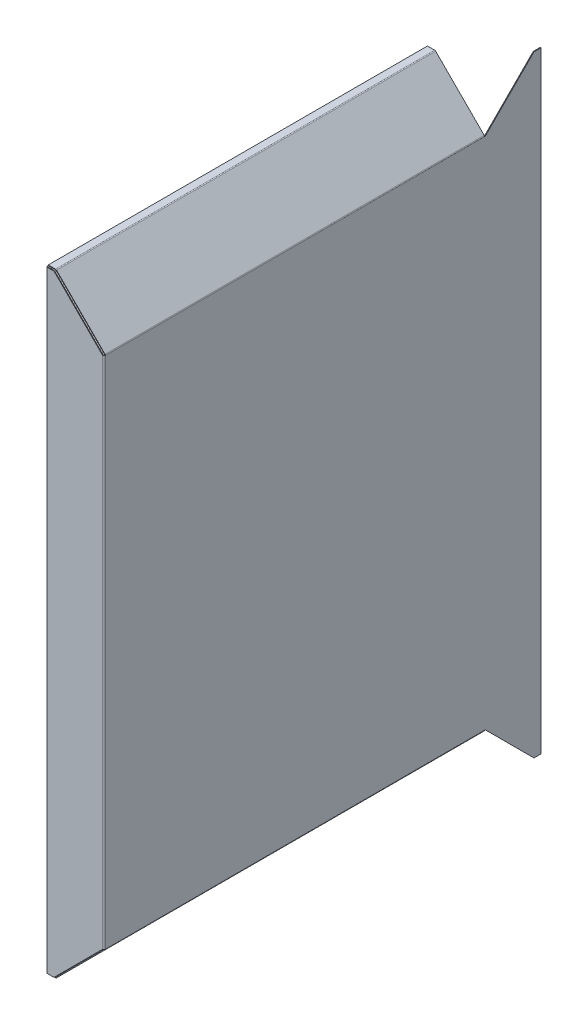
ISO-10303-21;
HEADER;
FILE_DESCRIPTION(('STEP AP214'),'2;1');
FILE_NAME('part.step','',(''),(''),'','','');
FILE_SCHEMA(('AUTOMOTIVE_DESIGN { 1 0 10303 214 1 1 1 1 }'));
ENDSEC;
DATA;
#1=APPLICATION_CONTEXT('core data for automotive mechanical design processes');
#2=APPLICATION_PROTOCOL_DEFINITION('international standard','automotive_design',2000,#1);
#3=PRODUCT_CONTEXT('',#1,'mechanical');
#4=PRODUCT('Part','Part','',(#3));
#5=PRODUCT_RELATED_PRODUCT_CATEGORY('part','',(#4));
#6=PRODUCT_DEFINITION_FORMATION('','',#4);
#7=PRODUCT_DEFINITION_CONTEXT('part definition',#1,'design');
#8=PRODUCT_DEFINITION('design','',#6,#7);
#9=PRODUCT_DEFINITION_SHAPE('','',#8);
#10=(LENGTH_UNIT() NAMED_UNIT(*) SI_UNIT(.MILLI.,.METRE.));
#11=(NAMED_UNIT(*) PLANE_ANGLE_UNIT() SI_UNIT($,.RADIAN.));
#12=(NAMED_UNIT(*) SI_UNIT($,.STERADIAN.) SOLID_ANGLE_UNIT());
#13=UNCERTAINTY_MEASURE_WITH_UNIT(LENGTH_MEASURE(1.E-05),#10,'distance_accuracy_value','');
#14=(GEOMETRIC_REPRESENTATION_CONTEXT(3) GLOBAL_UNCERTAINTY_ASSIGNED_CONTEXT((#13)) GLOBAL_UNIT_ASSIGNED_CONTEXT((#10,
#11,#12)) REPRESENTATION_CONTEXT('',''));
#15=CARTESIAN_POINT('',(0.,0.,0.));
#16=DIRECTION('',(0.,0.,1.));
#17=DIRECTION('',(1.,0.,0.));
#18=AXIS2_PLACEMENT_3D('',#15,#16,#17);
#19=CARTESIAN_POINT('',(72.4941444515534,-356.588086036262,-528.));
#20=DIRECTION('',(0.,0.,-1.));
#21=DIRECTION('',(-1.,0.,0.));
#22=AXIS2_PLACEMENT_3D('',#19,#20,#21);
#23=PLANE('',#22);
#24=DIRECTION('',(0.,-1.,0.));
#25=VECTOR('',#24,1.);
#26=CARTESIAN_POINT('',(73.4941447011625,-356.588086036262,-528.));
#27=LINE('',#26,#25);
#28=CARTESIAN_POINT('',(73.4941448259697,-356.588086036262,-528.));
#29=VERTEX_POINT('',#28);
#30=CARTESIAN_POINT('',(73.4941447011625,-357.002299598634,-528.));
#31=VERTEX_POINT('',#30);
#32=EDGE_CURVE('E346',#29,#31,#27,.T.);
#33=ORIENTED_EDGE('',*,*,#32,.T.);
#34=DIRECTION('',(1.,0.,0.));
#35=VECTOR('',#34,1.);
#36=CARTESIAN_POINT('',(72.4941444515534,-357.002299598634,-528.));
#37=LINE('',#36,#35);
#38=CARTESIAN_POINT('',(74.450781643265,-357.002299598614,-528.));
#39=VERTEX_POINT('',#38);
#40=EDGE_CURVE('E362',#31,#39,#37,.T.);
#41=ORIENTED_EDGE('',*,*,#40,.T.);
#42=CARTESIAN_POINT('',(72.4941444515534,-356.588086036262,-528.));
#43=DIRECTION('',(0.,0.,1.));
#44=DIRECTION('',(1.,0.,0.));
#45=AXIS2_PLACEMENT_3D('',#42,#43,#44);
#46=CIRCLE('',#45,2.00000046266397);
#47=CARTESIAN_POINT('',(73.908358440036,-358.002299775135,-528.));
#48=VERTEX_POINT('',#47);
#49=EDGE_CURVE('E575',#48,#39,#46,.T.);
#50=ORIENTED_EDGE('',*,*,#49,.F.);
#51=DIRECTION('',(0.707106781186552,-0.707106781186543,0.));
#52=VECTOR('',#51,1.);
#53=CARTESIAN_POINT('',(73.2012514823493,-357.295192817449,-528.));
#54=LINE('',#53,#52);
#55=CARTESIAN_POINT('',(73.2012514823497,-357.295192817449,-528.));
#56=VERTEX_POINT('',#55);
#57=EDGE_CURVE('E558',#56,#48,#54,.T.);
#58=ORIENTED_EDGE('',*,*,#57,.F.);
#59=CARTESIAN_POINT('',(72.4941447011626,-356.588086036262,-528.));
#60=DIRECTION('',(0.,0.,-1.));
#61=DIRECTION('',(-1.,0.,0.));
#62=AXIS2_PLACEMENT_3D('',#59,#60,#61);
#63=CIRCLE('',#62,1.00000024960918);
#64=EDGE_CURVE('E557',#56,#29,#63,.F.);
#65=ORIENTED_EDGE('',*,*,#64,.T.);
#66=EDGE_LOOP('',(#33,#41,#50,#58,#65));
#67=FACE_BOUND('',#66,.T.);
#68=ADVANCED_FACE('F71',(#67),#23,.T.);
#69=CARTESIAN_POINT('',(72.4941447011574,-356.588086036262,262.502015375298));
#70=DIRECTION('',(0.,0.,-1.));
#71=DIRECTION('',(-1.,0.,0.));
#72=AXIS2_PLACEMENT_3D('',#69,#70,#71);
#73=CYLINDRICAL_SURFACE('',#72,2.00000024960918);
#74=DIRECTION('',(0.,0.,-1.));
#75=VECTOR('',#74,1.);
#76=CARTESIAN_POINT('',(74.4507816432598,-357.002299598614,262.502015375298));
#77=LINE('',#76,#75);
#78=CARTESIAN_POINT('',(74.450781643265,-357.002299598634,-526.94));
#79=VERTEX_POINT('',#78);
#80=EDGE_CURVE('E13',#39,#79,#77,.F.);
#81=ORIENTED_EDGE('',*,*,#80,.T.);
#82=CARTESIAN_POINT('',(72.4941447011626,-356.588086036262,-526.94));
#83=DIRECTION('',(0.,0.,-1.));
#84=DIRECTION('',(-1.,0.,0.));
#85=AXIS2_PLACEMENT_3D('',#82,#83,#84);
#86=CIRCLE('',#85,2.00000024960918);
#87=CARTESIAN_POINT('',(74.4941447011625,-356.588086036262,-526.94));
#88=VERTEX_POINT('',#87);
#89=EDGE_CURVE('E356',#79,#88,#86,.F.);
#90=ORIENTED_EDGE('',*,*,#89,.T.);
#91=DIRECTION('',(0.,0.,-1.));
#92=VECTOR('',#91,1.);
#93=CARTESIAN_POINT('',(74.4941447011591,-356.588086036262,-0.999999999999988));
#94=LINE('',#93,#92);
#95=CARTESIAN_POINT('',(74.4941447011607,-356.588086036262,-0.999999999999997));
#96=VERTEX_POINT('',#95);
#97=EDGE_CURVE('E663',#96,#88,#94,.T.);
#98=ORIENTED_EDGE('',*,*,#97,.F.);
#99=CARTESIAN_POINT('',(72.4941444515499,-356.588086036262,-1.00000000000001));
#100=DIRECTION('',(0.,0.,-1.));
#101=DIRECTION('',(-1.,0.,0.));
#102=AXIS2_PLACEMENT_3D('',#99,#100,#101);
#103=CIRCLE('',#102,2.00000046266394);
#104=CARTESIAN_POINT('',(74.4507816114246,-357.002299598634,-0.999999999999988));
#105=VERTEX_POINT('',#104);
#106=EDGE_CURVE('E580',#96,#105,#103,.T.);
#107=ORIENTED_EDGE('',*,*,#106,.T.);
#108=CARTESIAN_POINT('',(73.9083582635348,-358.002299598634,-0.999999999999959));
#109=VERTEX_POINT('',#108);
#110=EDGE_CURVE('E578',#105,#109,#103,.T.);
#111=ORIENTED_EDGE('',*,*,#110,.T.);
#112=DIRECTION('',(0.,0.,1.));
#113=VECTOR('',#112,1.);
#114=CARTESIAN_POINT('',(73.9083582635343,-358.002299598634,-0.999999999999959));
#115=LINE('',#114,#113);
#116=EDGE_CURVE('E566',#48,#109,#115,.T.);
#117=ORIENTED_EDGE('',*,*,#116,.F.);
#118=ORIENTED_EDGE('',*,*,#49,.T.);
#119=EDGE_LOOP('',(#81,#90,#98,#107,#111,#117,#118));
#120=FACE_BOUND('',#119,.T.);
#121=ADVANCED_FACE('F699',(#120),#73,.T.);
#122=CARTESIAN_POINT('',(72.494144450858,357.583486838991,-528.));
#123=DIRECTION('',(0.,0.,-1.));
#124=DIRECTION('',(-1.,0.,0.));
#125=AXIS2_PLACEMENT_3D('',#122,#123,#124);
#126=PLANE('',#125);
#127=CARTESIAN_POINT('',(72.494144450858,357.583486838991,-528.));
#128=DIRECTION('',(0.,0.,1.));
#129=DIRECTION('',(1.,0.,0.));
#130=AXIS2_PLACEMENT_3D('',#127,#128,#129);
#131=CIRCLE('',#130,2.00000046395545);
#132=CARTESIAN_POINT('',(74.4507816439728,357.997700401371,-528.));
#133=VERTEX_POINT('',#132);
#134=CARTESIAN_POINT('',(73.9083582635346,358.997700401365,-528.));
#135=VERTEX_POINT('',#134);
#136=EDGE_CURVE('E475',#133,#135,#131,.T.);
#137=ORIENTED_EDGE('',*,*,#136,.F.);
#138=DIRECTION('',(-1.,0.,0.));
#139=VECTOR('',#138,1.);
#140=CARTESIAN_POINT('',(72.494144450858,357.997700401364,-528.));
#141=LINE('',#140,#139);
#142=CARTESIAN_POINT('',(73.4941447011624,357.997700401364,-528.));
#143=VERTEX_POINT('',#142);
#144=EDGE_CURVE('E359',#133,#143,#141,.T.);
#145=ORIENTED_EDGE('',*,*,#144,.T.);
#146=DIRECTION('',(0.,-1.,0.));
#147=VECTOR('',#146,1.);
#148=CARTESIAN_POINT('',(73.4941447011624,357.583486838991,-528.));
#149=LINE('',#148,#147);
#150=CARTESIAN_POINT('',(73.4941448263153,357.583486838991,-528.));
#151=VERTEX_POINT('',#150);
#152=EDGE_CURVE('E343',#143,#151,#149,.T.);
#153=ORIENTED_EDGE('',*,*,#152,.T.);
#154=CARTESIAN_POINT('',(72.4941447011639,357.583486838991,-528.));
#155=DIRECTION('',(0.,0.,1.));
#156=DIRECTION('',(1.,0.,0.));
#157=AXIS2_PLACEMENT_3D('',#154,#155,#156);
#158=CIRCLE('',#157,1.00000025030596);
#159=CARTESIAN_POINT('',(73.2012514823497,358.290593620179,-528.));
#160=VERTEX_POINT('',#159);
#161=EDGE_CURVE('E476',#151,#160,#158,.T.);
#162=ORIENTED_EDGE('',*,*,#161,.T.);
#163=DIRECTION('',(0.707106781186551,0.707106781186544,0.));
#164=VECTOR('',#163,1.);
#165=CARTESIAN_POINT('',(73.2012514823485,358.290593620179,-528.));
#166=LINE('',#165,#164);
#167=EDGE_CURVE('E463',#160,#135,#166,.T.);
#168=ORIENTED_EDGE('',*,*,#167,.T.);
#169=EDGE_LOOP('',(#137,#145,#153,#162,#168));
#170=FACE_BOUND('',#169,.T.);
#171=ADVANCED_FACE('F757',(#170),#126,.T.);
#172=CARTESIAN_POINT('',(72.4941447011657,357.583486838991,-791.502015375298));
#173=DIRECTION('',(0.,0.,1.));
#174=DIRECTION('',(1.,0.,0.));
#175=AXIS2_PLACEMENT_3D('',#172,#173,#174);
#176=CYLINDRICAL_SURFACE('',#175,2.00000025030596);
#177=CARTESIAN_POINT('',(72.4941447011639,357.583486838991,-526.94));
#178=DIRECTION('',(0.,0.,-1.));
#179=DIRECTION('',(-1.,0.,0.));
#180=AXIS2_PLACEMENT_3D('',#177,#178,#179);
#181=CIRCLE('',#180,2.00000025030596);
#182=CARTESIAN_POINT('',(74.4941447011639,357.583486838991,-526.94));
#183=VERTEX_POINT('',#182);
#184=CARTESIAN_POINT('',(74.4507816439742,357.997700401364,-526.94));
#185=VERTEX_POINT('',#184);
#186=EDGE_CURVE('E326',#183,#185,#181,.F.);
#187=ORIENTED_EDGE('',*,*,#186,.T.);
#188=DIRECTION('',(0.,0.,1.));
#189=VECTOR('',#188,1.);
#190=CARTESIAN_POINT('',(74.4507816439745,357.997700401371,-791.502015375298));
#191=LINE('',#190,#189);
#192=EDGE_CURVE('E79',#185,#133,#191,.F.);
#193=ORIENTED_EDGE('',*,*,#192,.T.);
#194=ORIENTED_EDGE('',*,*,#136,.T.);
#195=DIRECTION('',(0.,0.,1.));
#196=VECTOR('',#195,1.);
#197=CARTESIAN_POINT('',(73.9083582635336,358.997700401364,-1.00000000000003));
#198=LINE('',#197,#196);
#199=CARTESIAN_POINT('',(73.9083584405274,358.997700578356,-1.));
#200=VERTEX_POINT('',#199);
#201=EDGE_CURVE('E446',#135,#200,#198,.T.);
#202=ORIENTED_EDGE('',*,*,#201,.T.);
#203=CARTESIAN_POINT('',(72.4941444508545,357.583486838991,-1.00000000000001));
#204=DIRECTION('',(0.,0.,-1.));
#205=DIRECTION('',(-1.,0.,0.));
#206=AXIS2_PLACEMENT_3D('',#203,#204,#205);
#207=CIRCLE('',#206,2.00000046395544);
#208=CARTESIAN_POINT('',(74.4507816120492,357.997700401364,-1.));
#209=VERTEX_POINT('',#208);
#210=EDGE_CURVE('E471',#200,#209,#207,.T.);
#211=ORIENTED_EDGE('',*,*,#210,.T.);
#212=CARTESIAN_POINT('',(74.49414491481,357.583486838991,-0.99999999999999));
#213=VERTEX_POINT('',#212);
#214=EDGE_CURVE('E479',#209,#213,#207,.T.);
#215=ORIENTED_EDGE('',*,*,#214,.T.);
#216=DIRECTION('',(0.,0.,1.));
#217=VECTOR('',#216,1.);
#218=CARTESIAN_POINT('',(74.4941447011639,357.583486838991,-528.));
#219=LINE('',#218,#217);
#220=EDGE_CURVE('E509',#183,#213,#219,.T.);
#221=ORIENTED_EDGE('',*,*,#220,.F.);
#222=EDGE_LOOP('',(#187,#193,#194,#202,#211,#215,#221));
#223=FACE_BOUND('',#222,.T.);
#224=ADVANCED_FACE('F814',(#223),#176,.T.);
#225=CARTESIAN_POINT('',(74.4941447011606,357.583486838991,-0.999999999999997));
#226=DIRECTION('',(0.,0.,1.));
#227=DIRECTION('',(1.,0.,0.));
#228=AXIS2_PLACEMENT_3D('',#225,#226,#227);
#229=PLANE('',#228);
#230=ORIENTED_EDGE('',*,*,#214,.F.);
#231=DIRECTION('',(1.,0.,0.));
#232=VECTOR('',#231,1.);
#233=CARTESIAN_POINT('',(74.4941447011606,357.997700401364,-0.999999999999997));
#234=LINE('',#233,#232);
#235=CARTESIAN_POINT('',(74.494144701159,357.997700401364,-1.));
#236=VERTEX_POINT('',#235);
#237=EDGE_CURVE('E485',#209,#236,#234,.T.);
#238=ORIENTED_EDGE('',*,*,#237,.T.);
#239=DIRECTION('',(0.,1.,0.));
#240=VECTOR('',#239,1.);
#241=CARTESIAN_POINT('',(74.4941447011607,-357.002299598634,-0.999999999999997));
#242=LINE('',#241,#240);
#243=EDGE_CURVE('E647',#213,#236,#242,.T.);
#244=ORIENTED_EDGE('',*,*,#243,.F.);
#245=EDGE_LOOP('',(#230,#238,#244));
#246=FACE_BOUND('',#245,.T.);
#247=ADVANCED_FACE('F73',(#246),#229,.F.);
#248=CARTESIAN_POINT('',(74.4941447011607,-356.588086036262,-0.999999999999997));
#249=DIRECTION('',(0.,0.,-1.));
#250=DIRECTION('',(-1.,0.,0.));
#251=AXIS2_PLACEMENT_3D('',#248,#249,#250);
#252=PLANE('',#251);
#253=ORIENTED_EDGE('',*,*,#106,.F.);
#254=DIRECTION('',(0.,1.,0.));
#255=VECTOR('',#254,1.);
#256=CARTESIAN_POINT('',(74.4941447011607,-357.002299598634,-0.999999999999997));
#257=LINE('',#256,#255);
#258=CARTESIAN_POINT('',(74.4941447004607,-357.002299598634,-0.999999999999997));
#259=VERTEX_POINT('',#258);
#260=EDGE_CURVE('E639',#259,#96,#257,.T.);
#261=ORIENTED_EDGE('',*,*,#260,.F.);
#262=DIRECTION('',(1.,0.,0.));
#263=VECTOR('',#262,1.);
#264=CARTESIAN_POINT('',(74.4941447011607,-357.002299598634,-0.999999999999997));
#265=LINE('',#264,#263);
#266=EDGE_CURVE('E515',#105,#259,#265,.T.);
#267=ORIENTED_EDGE('',*,*,#266,.F.);
#268=EDGE_LOOP('',(#253,#261,#267));
#269=FACE_BOUND('',#268,.T.);
#270=ADVANCED_FACE('F807',(#269),#252,.T.);
#271=CARTESIAN_POINT('',(74.4941447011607,-357.002299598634,0.));
#272=DIRECTION('',(-1.,0.,0.));
#273=DIRECTION('',(0.,0.,1.));
#274=AXIS2_PLACEMENT_3D('',#271,#272,#273);
#275=PLANE('',#274);
#276=DIRECTION('',(0.,-1.,0.));
#277=VECTOR('',#276,1.);
#278=CARTESIAN_POINT('',(74.4941447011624,357.997700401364,-526.94));
#279=LINE('',#278,#277);
#280=CARTESIAN_POINT('',(74.4941447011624,357.997700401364,-526.94));
#281=VERTEX_POINT('',#280);
#282=EDGE_CURVE('E86',#281,#183,#279,.T.);
#283=ORIENTED_EDGE('',*,*,#282,.T.);
#284=ORIENTED_EDGE('',*,*,#220,.T.);
#285=DIRECTION('',(0.,1.,0.));
#286=VECTOR('',#285,1.);
#287=CARTESIAN_POINT('',(74.4941447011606,357.997700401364,-0.999999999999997));
#288=LINE('',#287,#286);
#289=EDGE_CURVE('E642',#96,#213,#288,.T.);
#290=ORIENTED_EDGE('',*,*,#289,.F.);
#291=ORIENTED_EDGE('',*,*,#97,.T.);
#292=CARTESIAN_POINT('',(74.4941447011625,-357.002299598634,-526.94));
#293=VERTEX_POINT('',#292);
#294=EDGE_CURVE('E329',#88,#293,#279,.T.);
#295=ORIENTED_EDGE('',*,*,#294,.T.);
#296=DIRECTION('',(0.,0.,-1.));
#297=VECTOR('',#296,1.);
#298=CARTESIAN_POINT('',(74.4941447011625,-357.002299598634,-529.120575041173));
#299=LINE('',#298,#297);
#300=CARTESIAN_POINT('',(74.4941447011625,-357.002299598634,-529.120575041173));
#301=VERTEX_POINT('',#300);
#302=EDGE_CURVE('E328',#293,#301,#299,.T.);
#303=ORIENTED_EDGE('',*,*,#302,.T.);
#304=DIRECTION('',(0.,-0.707106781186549,-0.707106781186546));
#305=VECTOR('',#304,1.);
#306=CARTESIAN_POINT('',(74.4941447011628,-424.502299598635,-596.620575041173));
#307=LINE('',#306,#305);
#308=CARTESIAN_POINT('',(74.4941447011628,-424.502299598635,-596.620575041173));
#309=VERTEX_POINT('',#308);
#310=EDGE_CURVE('E831',#301,#309,#307,.T.);
#311=ORIENTED_EDGE('',*,*,#310,.T.);
#312=DIRECTION('',(0.,0.,-1.));
#313=VECTOR('',#312,1.);
#314=CARTESIAN_POINT('',(74.4941447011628,-424.502299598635,-606.620575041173));
#315=LINE('',#314,#313);
#316=CARTESIAN_POINT('',(74.4941447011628,-424.502299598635,-606.620575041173));
#317=VERTEX_POINT('',#316);
#318=EDGE_CURVE('E833',#309,#317,#315,.T.);
#319=ORIENTED_EDGE('',*,*,#318,.T.);
#320=DIRECTION('',(0.,1.,0.));
#321=VECTOR('',#320,1.);
#322=CARTESIAN_POINT('',(74.4941447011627,425.497700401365,-606.620575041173));
#323=LINE('',#322,#321);
#324=CARTESIAN_POINT('',(74.4941447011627,425.497700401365,-606.620575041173));
#325=VERTEX_POINT('',#324);
#326=EDGE_CURVE('E837',#317,#325,#323,.T.);
#327=ORIENTED_EDGE('',*,*,#326,.T.);
#328=DIRECTION('',(0.,0.,1.));
#329=VECTOR('',#328,1.);
#330=CARTESIAN_POINT('',(74.4941447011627,425.497700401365,-606.620575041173));
#331=LINE('',#330,#329);
#332=CARTESIAN_POINT('',(74.4941447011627,425.497700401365,-596.620575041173));
#333=VERTEX_POINT('',#332);
#334=EDGE_CURVE('E839',#325,#333,#331,.T.);
#335=ORIENTED_EDGE('',*,*,#334,.T.);
#336=DIRECTION('',(0.,-0.707106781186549,0.707106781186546));
#337=VECTOR('',#336,1.);
#338=CARTESIAN_POINT('',(74.4941447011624,357.997700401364,-529.120575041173));
#339=LINE('',#338,#337);
#340=CARTESIAN_POINT('',(74.4941447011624,357.997700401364,-529.120575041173));
#341=VERTEX_POINT('',#340);
#342=EDGE_CURVE('E335',#333,#341,#339,.T.);
#343=ORIENTED_EDGE('',*,*,#342,.T.);
#344=DIRECTION('',(0.,0.,1.));
#345=VECTOR('',#344,1.);
#346=CARTESIAN_POINT('',(74.4941447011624,357.997700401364,-529.120575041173));
#347=LINE('',#346,#345);
#348=EDGE_CURVE('E332',#341,#281,#347,.T.);
#349=ORIENTED_EDGE('',*,*,#348,.T.);
#350=EDGE_LOOP('',(#283,#284,#290,#291,#295,#303,#311,#319,#327,#335,#343,#349));
#351=FACE_BOUND('',#350,.T.);
#352=ADVANCED_FACE('F333',(#351),#275,.F.);
#353=CARTESIAN_POINT('',(73.4941447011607,-357.002299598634,0.));
#354=DIRECTION('',(-1.,0.,0.));
#355=DIRECTION('',(0.,0.,1.));
#356=AXIS2_PLACEMENT_3D('',#353,#354,#355);
#357=PLANE('',#356);
#358=ORIENTED_EDGE('',*,*,#32,.F.);
#359=DIRECTION('',(0.,0.,-1.));
#360=VECTOR('',#359,1.);
#361=CARTESIAN_POINT('',(73.4941447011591,-356.588086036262,-0.999999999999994));
#362=LINE('',#361,#360);
#363=CARTESIAN_POINT('',(73.4941447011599,-356.588086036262,-1.));
#364=VERTEX_POINT('',#363);
#365=EDGE_CURVE('E511',#364,#29,#362,.T.);
#366=ORIENTED_EDGE('',*,*,#365,.F.);
#367=DIRECTION('',(0.,-1.,0.));
#368=VECTOR('',#367,1.);
#369=CARTESIAN_POINT('',(73.4941447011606,357.997700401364,-1.));
#370=LINE('',#369,#368);
#371=CARTESIAN_POINT('',(73.4941447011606,357.583486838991,-1.));
#372=VERTEX_POINT('',#371);
#373=EDGE_CURVE('E529',#372,#364,#370,.T.);
#374=ORIENTED_EDGE('',*,*,#373,.F.);
#375=DIRECTION('',(0.,0.,1.));
#376=VECTOR('',#375,1.);
#377=CARTESIAN_POINT('',(73.4941447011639,357.583486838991,-528.));
#378=LINE('',#377,#376);
#379=EDGE_CURVE('E484',#151,#372,#378,.T.);
#380=ORIENTED_EDGE('',*,*,#379,.F.);
#381=ORIENTED_EDGE('',*,*,#152,.F.);
#382=DIRECTION('',(0.,0.,1.));
#383=VECTOR('',#382,1.);
#384=CARTESIAN_POINT('',(73.4941447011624,357.997700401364,-529.120575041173));
#385=LINE('',#384,#383);
#386=CARTESIAN_POINT('',(73.4941447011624,357.997700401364,-529.120575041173));
#387=VERTEX_POINT('',#386);
#388=EDGE_CURVE('E843',#387,#143,#385,.T.);
#389=ORIENTED_EDGE('',*,*,#388,.F.);
#390=DIRECTION('',(0.,-0.707106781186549,0.707106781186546));
#391=VECTOR('',#390,1.);
#392=CARTESIAN_POINT('',(73.4941447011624,357.997700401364,-529.120575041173));
#393=LINE('',#392,#391);
#394=CARTESIAN_POINT('',(73.4941447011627,425.497700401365,-596.620575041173));
#395=VERTEX_POINT('',#394);
#396=EDGE_CURVE('E339',#395,#387,#393,.T.);
#397=ORIENTED_EDGE('',*,*,#396,.F.);
#398=DIRECTION('',(0.,0.,1.));
#399=VECTOR('',#398,1.);
#400=CARTESIAN_POINT('',(73.4941447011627,425.497700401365,-606.620575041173));
#401=LINE('',#400,#399);
#402=CARTESIAN_POINT('',(73.4941447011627,425.497700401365,-606.620575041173));
#403=VERTEX_POINT('',#402);
#404=EDGE_CURVE('E853',#403,#395,#401,.T.);
#405=ORIENTED_EDGE('',*,*,#404,.F.);
#406=DIRECTION('',(0.,1.,0.));
#407=VECTOR('',#406,1.);
#408=CARTESIAN_POINT('',(73.4941447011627,425.497700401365,-606.620575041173));
#409=LINE('',#408,#407);
#410=CARTESIAN_POINT('',(73.4941447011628,-424.502299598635,-606.620575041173));
#411=VERTEX_POINT('',#410);
#412=EDGE_CURVE('E851',#411,#403,#409,.T.);
#413=ORIENTED_EDGE('',*,*,#412,.F.);
#414=DIRECTION('',(0.,0.,-1.));
#415=VECTOR('',#414,1.);
#416=CARTESIAN_POINT('',(73.4941447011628,-424.502299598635,-606.620575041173));
#417=LINE('',#416,#415);
#418=CARTESIAN_POINT('',(73.4941447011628,-424.502299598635,-596.620575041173));
#419=VERTEX_POINT('',#418);
#420=EDGE_CURVE('E849',#419,#411,#417,.T.);
#421=ORIENTED_EDGE('',*,*,#420,.F.);
#422=DIRECTION('',(0.,-0.707106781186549,-0.707106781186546));
#423=VECTOR('',#422,1.);
#424=CARTESIAN_POINT('',(73.4941447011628,-424.502299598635,-596.620575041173));
#425=LINE('',#424,#423);
#426=CARTESIAN_POINT('',(73.4941447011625,-357.002299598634,-529.120575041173));
#427=VERTEX_POINT('',#426);
#428=EDGE_CURVE('E847',#427,#419,#425,.T.);
#429=ORIENTED_EDGE('',*,*,#428,.F.);
#430=DIRECTION('',(0.,0.,-1.));
#431=VECTOR('',#430,1.);
#432=CARTESIAN_POINT('',(73.4941447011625,-357.002299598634,-529.120575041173));
#433=LINE('',#432,#431);
#434=EDGE_CURVE('E684',#31,#427,#433,.T.);
#435=ORIENTED_EDGE('',*,*,#434,.F.);
#436=EDGE_LOOP('',(#358,#366,#374,#380,#381,#389,#397,#405,#413,#421,#429,#435));
#437=FACE_BOUND('',#436,.T.);
#438=ADVANCED_FACE('F532',(#437),#357,.T.);
#439=CARTESIAN_POINT('',(72.4941447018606,357.997700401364,-1.));
#440=DIRECTION('',(0.,1.,0.));
#441=DIRECTION('',(0.,0.,1.));
#442=AXIS2_PLACEMENT_3D('',#439,#440,#441);
#443=PLANE('',#442);
#444=CARTESIAN_POINT('',(73.4941447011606,357.997700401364,-1.));
#445=VERTEX_POINT('',#444);
#446=EDGE_CURVE('E547',#445,#209,#234,.T.);
#447=ORIENTED_EDGE('',*,*,#446,.F.);
#448=CARTESIAN_POINT('',(72.4941447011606,357.997700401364,-1.));
#449=DIRECTION('',(0.,-1.,0.));
#450=DIRECTION('',(1.,0.,0.));
#451=AXIS2_PLACEMENT_3D('',#448,#449,#450);
#452=CIRCLE('',#451,0.999999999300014);
#453=CARTESIAN_POINT('',(72.4941447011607,357.997700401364,0.));
#454=VERTEX_POINT('',#453);
#455=EDGE_CURVE('E544',#445,#454,#452,.T.);
#456=ORIENTED_EDGE('',*,*,#455,.T.);
#457=DIRECTION('',(0.,0.,-1.));
#458=VECTOR('',#457,1.);
#459=CARTESIAN_POINT('',(72.4941447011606,357.997700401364,1.));
#460=LINE('',#459,#458);
#461=CARTESIAN_POINT('',(72.4941447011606,357.997700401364,1.));
#462=VERTEX_POINT('',#461);
#463=EDGE_CURVE('E593',#462,#454,#460,.T.);
#464=ORIENTED_EDGE('',*,*,#463,.F.);
#465=CARTESIAN_POINT('',(72.4941447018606,357.997700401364,-1.));
#466=DIRECTION('',(0.,-1.,0.));
#467=DIRECTION('',(0.,0.,-1.));
#468=AXIS2_PLACEMENT_3D('',#465,#466,#467);
#469=CIRCLE('',#468,1.99999999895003);
#470=EDGE_CURVE('E632',#236,#462,#469,.T.);
#471=ORIENTED_EDGE('',*,*,#470,.F.);
#472=ORIENTED_EDGE('',*,*,#237,.F.);
#473=EDGE_LOOP('',(#447,#456,#464,#471,#472));
#474=FACE_BOUND('',#473,.T.);
#475=ADVANCED_FACE('F796',(#474),#443,.T.);
#476=CARTESIAN_POINT('',(72.4941447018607,-357.002299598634,-1.));
#477=DIRECTION('',(0.,-1.,0.));
#478=DIRECTION('',(0.,0.,-1.));
#479=AXIS2_PLACEMENT_3D('',#476,#477,#478);
#480=PLANE('',#479);
#481=CARTESIAN_POINT('',(72.4941447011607,-357.002299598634,-1.));
#482=DIRECTION('',(0.,-1.,0.));
#483=DIRECTION('',(1.,0.,0.));
#484=AXIS2_PLACEMENT_3D('',#481,#482,#483);
#485=CIRCLE('',#484,0.999999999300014);
#486=CARTESIAN_POINT('',(72.4941447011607,-357.002299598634,0.));
#487=VERTEX_POINT('',#486);
#488=CARTESIAN_POINT('',(73.4941447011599,-357.002299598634,-1.));
#489=VERTEX_POINT('',#488);
#490=EDGE_CURVE('E636',#487,#489,#485,.F.);
#491=ORIENTED_EDGE('',*,*,#490,.T.);
#492=EDGE_CURVE('E662',#489,#105,#265,.T.);
#493=ORIENTED_EDGE('',*,*,#492,.T.);
#494=ORIENTED_EDGE('',*,*,#266,.T.);
#495=CARTESIAN_POINT('',(72.4941447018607,-357.002299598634,-1.));
#496=DIRECTION('',(0.,1.,0.));
#497=DIRECTION('',(0.,0.,1.));
#498=AXIS2_PLACEMENT_3D('',#495,#496,#497);
#499=CIRCLE('',#498,1.99999999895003);
#500=CARTESIAN_POINT('',(72.4941447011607,-357.002299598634,0.99999999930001));
#501=VERTEX_POINT('',#500);
#502=EDGE_CURVE('E635',#501,#259,#499,.T.);
#503=ORIENTED_EDGE('',*,*,#502,.F.);
#504=DIRECTION('',(0.,0.,-1.));
#505=VECTOR('',#504,1.);
#506=CARTESIAN_POINT('',(72.4941447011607,-357.002299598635,1.));
#507=LINE('',#506,#505);
#508=EDGE_CURVE('E583',#501,#487,#507,.T.);
#509=ORIENTED_EDGE('',*,*,#508,.T.);
#510=EDGE_LOOP('',(#491,#493,#494,#503,#509));
#511=FACE_BOUND('',#510,.T.);
#512=ADVANCED_FACE('F794',(#511),#480,.T.);
#513=CARTESIAN_POINT('',(72.4941447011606,715.501544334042,-1.));
#514=DIRECTION('',(0.,-1.,0.));
#515=DIRECTION('',(1.,0.,0.));
#516=AXIS2_PLACEMENT_3D('',#513,#514,#515);
#517=CYLINDRICAL_SURFACE('',#516,1.99999999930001);
#518=DIRECTION('',(0.,1.,0.));
#519=VECTOR('',#518,1.);
#520=CARTESIAN_POINT('',(72.4941447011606,357.997700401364,1.));
#521=LINE('',#520,#519);
#522=EDGE_CURVE('E602',#501,#462,#521,.T.);
#523=ORIENTED_EDGE('',*,*,#522,.F.);
#524=ORIENTED_EDGE('',*,*,#502,.T.);
#525=ORIENTED_EDGE('',*,*,#260,.T.);
#526=ORIENTED_EDGE('',*,*,#289,.T.);
#527=ORIENTED_EDGE('',*,*,#243,.T.);
#528=ORIENTED_EDGE('',*,*,#470,.T.);
#529=EDGE_LOOP('',(#523,#524,#525,#526,#527,#528));
#530=FACE_BOUND('',#529,.T.);
#531=ADVANCED_FACE('F791',(#530),#517,.T.);
#532=CARTESIAN_POINT('',(72.4941447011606,715.501544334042,-1.));
#533=DIRECTION('',(0.,-1.,0.));
#534=DIRECTION('',(1.,0.,0.));
#535=AXIS2_PLACEMENT_3D('',#532,#533,#534);
#536=CYLINDRICAL_SURFACE('',#535,0.999999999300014);
#537=DIRECTION('',(0.,1.,0.));
#538=VECTOR('',#537,1.);
#539=CARTESIAN_POINT('',(72.4941447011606,357.997700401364,0.));
#540=LINE('',#539,#538);
#541=EDGE_CURVE('E628',#487,#454,#540,.T.);
#542=ORIENTED_EDGE('',*,*,#541,.T.);
#543=ORIENTED_EDGE('',*,*,#455,.F.);
#544=DIRECTION('',(0.,-1.,0.));
#545=VECTOR('',#544,1.);
#546=CARTESIAN_POINT('',(73.4941447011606,357.997700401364,-1.));
#547=LINE('',#546,#545);
#548=EDGE_CURVE('E537',#445,#372,#547,.T.);
#549=ORIENTED_EDGE('',*,*,#548,.T.);
#550=ORIENTED_EDGE('',*,*,#373,.T.);
#551=DIRECTION('',(-3.48441012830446E-12,1.,-2.63320056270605E-13));
#552=VECTOR('',#551,1.);
#553=CARTESIAN_POINT('',(73.4941447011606,-357.002299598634,-1.));
#554=LINE('',#553,#552);
#555=EDGE_CURVE('E536',#489,#364,#554,.T.);
#556=ORIENTED_EDGE('',*,*,#555,.F.);
#557=ORIENTED_EDGE('',*,*,#490,.F.);
#558=EDGE_LOOP('',(#542,#543,#549,#550,#556,#557));
#559=FACE_BOUND('',#558,.T.);
#560=ADVANCED_FACE('F542',(#559),#536,.F.);
#561=CARTESIAN_POINT('',(-5.00585529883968,425.497700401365,1.));
#562=DIRECTION('',(0.,-1.,0.));
#563=DIRECTION('',(0.,0.,-1.));
#564=AXIS2_PLACEMENT_3D('',#561,#562,#563);
#565=PLANE('',#564);
#566=DIRECTION('',(-1.,0.,0.));
#567=VECTOR('',#566,1.);
#568=CARTESIAN_POINT('',(-5.00585529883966,425.497700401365,0.));
#569=LINE('',#568,#567);
#570=CARTESIAN_POINT('',(4.99414470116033,425.497700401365,0.));
#571=VERTEX_POINT('',#570);
#572=CARTESIAN_POINT('',(-5.00585529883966,425.497700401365,0.));
#573=VERTEX_POINT('',#572);
#574=EDGE_CURVE('E626',#571,#573,#569,.T.);
#575=ORIENTED_EDGE('',*,*,#574,.T.);
#576=DIRECTION('',(0.,0.,-1.));
#577=VECTOR('',#576,1.);
#578=CARTESIAN_POINT('',(-5.00585529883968,425.497700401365,1.));
#579=LINE('',#578,#577);
#580=CARTESIAN_POINT('',(-5.00585529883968,425.497700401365,1.));
#581=VERTEX_POINT('',#580);
#582=EDGE_CURVE('E612',#581,#573,#579,.T.);
#583=ORIENTED_EDGE('',*,*,#582,.F.);
#584=DIRECTION('',(-1.,0.,0.));
#585=VECTOR('',#584,1.);
#586=CARTESIAN_POINT('',(-5.00585529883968,425.497700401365,1.));
#587=LINE('',#586,#585);
#588=CARTESIAN_POINT('',(4.99414470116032,425.497700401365,0.999999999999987));
#589=VERTEX_POINT('',#588);
#590=EDGE_CURVE('E598',#589,#581,#587,.T.);
#591=ORIENTED_EDGE('',*,*,#590,.F.);
#592=DIRECTION('',(0.,0.,-1.));
#593=VECTOR('',#592,1.);
#594=CARTESIAN_POINT('',(4.99414470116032,425.497700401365,0.999999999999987));
#595=LINE('',#594,#593);
#596=EDGE_CURVE('E623',#589,#571,#595,.T.);
#597=ORIENTED_EDGE('',*,*,#596,.T.);
#598=EDGE_LOOP('',(#575,#583,#591,#597));
#599=FACE_BOUND('',#598,.T.);
#600=ADVANCED_FACE('F764',(#599),#565,.F.);
#601=CARTESIAN_POINT('',(-5.00585529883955,-424.502299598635,1.));
#602=DIRECTION('',(0.,1.,0.));
#603=DIRECTION('',(0.,0.,1.));
#604=AXIS2_PLACEMENT_3D('',#601,#602,#603);
#605=PLANE('',#604);
#606=DIRECTION('',(1.,0.,0.));
#607=VECTOR('',#606,1.);
#608=CARTESIAN_POINT('',(-5.00585529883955,-424.502299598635,0.));
#609=LINE('',#608,#607);
#610=CARTESIAN_POINT('',(-5.00585529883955,-424.502299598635,0.));
#611=VERTEX_POINT('',#610);
#612=CARTESIAN_POINT('',(4.99414470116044,-424.502299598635,0.));
#613=VERTEX_POINT('',#612);
#614=EDGE_CURVE('E621',#611,#613,#609,.T.);
#615=ORIENTED_EDGE('',*,*,#614,.T.);
#616=DIRECTION('',(0.,0.,-1.));
#617=VECTOR('',#616,1.);
#618=CARTESIAN_POINT('',(4.99414470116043,-424.502299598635,0.999999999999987));
#619=LINE('',#618,#617);
#620=CARTESIAN_POINT('',(4.99414470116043,-424.502299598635,0.999999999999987));
#621=VERTEX_POINT('',#620);
#622=EDGE_CURVE('E588',#621,#613,#619,.T.);
#623=ORIENTED_EDGE('',*,*,#622,.F.);
#624=DIRECTION('',(1.,0.,0.));
#625=VECTOR('',#624,1.);
#626=CARTESIAN_POINT('',(-5.00585529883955,-424.502299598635,1.));
#627=LINE('',#626,#625);
#628=CARTESIAN_POINT('',(-5.00585529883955,-424.502299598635,1.));
#629=VERTEX_POINT('',#628);
#630=EDGE_CURVE('E607',#629,#621,#627,.T.);
#631=ORIENTED_EDGE('',*,*,#630,.F.);
#632=DIRECTION('',(0.,0.,-1.));
#633=VECTOR('',#632,1.);
#634=CARTESIAN_POINT('',(-5.00585529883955,-424.502299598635,1.));
#635=LINE('',#634,#633);
#636=EDGE_CURVE('E618',#629,#611,#635,.T.);
#637=ORIENTED_EDGE('',*,*,#636,.T.);
#638=EDGE_LOOP('',(#615,#623,#631,#637));
#639=FACE_BOUND('',#638,.T.);
#640=ADVANCED_FACE('F767',(#639),#605,.F.);
#641=CARTESIAN_POINT('',(-5.00585529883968,425.497700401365,1.));
#642=DIRECTION('',(1.,0.,0.));
#643=DIRECTION('',(0.,1.,0.));
#644=AXIS2_PLACEMENT_3D('',#641,#642,#643);
#645=PLANE('',#644);
#646=DIRECTION('',(0.,-1.,0.));
#647=VECTOR('',#646,1.);
#648=CARTESIAN_POINT('',(-5.00585529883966,425.497700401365,0.));
#649=LINE('',#648,#647);
#650=EDGE_CURVE('E615',#573,#611,#649,.T.);
#651=ORIENTED_EDGE('',*,*,#650,.T.);
#652=ORIENTED_EDGE('',*,*,#636,.F.);
#653=DIRECTION('',(0.,-1.,0.));
#654=VECTOR('',#653,1.);
#655=CARTESIAN_POINT('',(-5.00585529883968,425.497700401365,1.));
#656=LINE('',#655,#654);
#657=EDGE_CURVE('E609',#581,#629,#656,.T.);
#658=ORIENTED_EDGE('',*,*,#657,.F.);
#659=ORIENTED_EDGE('',*,*,#582,.T.);
#660=EDGE_LOOP('',(#651,#652,#658,#659));
#661=FACE_BOUND('',#660,.T.);
#662=ADVANCED_FACE('F771',(#661),#645,.F.);
#663=CARTESIAN_POINT('',(-5.00585529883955,-424.502299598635,1.));
#664=DIRECTION('',(0.,0.,1.));
#665=DIRECTION('',(1.,0.,0.));
#666=AXIS2_PLACEMENT_3D('',#663,#664,#665);
#667=PLANE('',#666);
#668=ORIENTED_EDGE('',*,*,#657,.T.);
#669=ORIENTED_EDGE('',*,*,#630,.T.);
#670=DIRECTION('',(0.707106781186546,0.707106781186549,0.));
#671=VECTOR('',#670,1.);
#672=CARTESIAN_POINT('',(4.99414470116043,-424.502299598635,0.999999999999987));
#673=LINE('',#672,#671);
#674=EDGE_CURVE('E604',#621,#501,#673,.T.);
#675=ORIENTED_EDGE('',*,*,#674,.T.);
#676=ORIENTED_EDGE('',*,*,#522,.T.);
#677=DIRECTION('',(-0.707106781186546,0.707106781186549,0.));
#678=VECTOR('',#677,1.);
#679=CARTESIAN_POINT('',(4.99414470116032,425.497700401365,0.999999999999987));
#680=LINE('',#679,#678);
#681=EDGE_CURVE('E600',#462,#589,#680,.T.);
#682=ORIENTED_EDGE('',*,*,#681,.T.);
#683=ORIENTED_EDGE('',*,*,#590,.T.);
#684=EDGE_LOOP('',(#668,#669,#675,#676,#682,#683));
#685=FACE_BOUND('',#684,.T.);
#686=ADVANCED_FACE('F775',(#685),#667,.T.);
#687=CARTESIAN_POINT('',(4.99414470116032,425.497700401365,0.999999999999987));
#688=DIRECTION('',(-0.707106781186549,-0.707106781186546,0.));
#689=DIRECTION('',(0.707106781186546,-0.707106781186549,0.));
#690=AXIS2_PLACEMENT_3D('',#687,#688,#689);
#691=PLANE('',#690);
#692=DIRECTION('',(-0.707106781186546,0.707106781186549,0.));
#693=VECTOR('',#692,1.);
#694=CARTESIAN_POINT('',(4.99414470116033,425.497700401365,0.));
#695=LINE('',#694,#693);
#696=EDGE_CURVE('E596',#454,#571,#695,.T.);
#697=ORIENTED_EDGE('',*,*,#696,.T.);
#698=ORIENTED_EDGE('',*,*,#596,.F.);
#699=ORIENTED_EDGE('',*,*,#681,.F.);
#700=ORIENTED_EDGE('',*,*,#463,.T.);
#701=EDGE_LOOP('',(#697,#698,#699,#700));
#702=FACE_BOUND('',#701,.T.);
#703=ADVANCED_FACE('F779',(#702),#691,.F.);
#704=CARTESIAN_POINT('',(-5.00585529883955,-424.502299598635,0.));
#705=DIRECTION('',(0.,0.,1.));
#706=DIRECTION('',(1.,0.,0.));
#707=AXIS2_PLACEMENT_3D('',#704,#705,#706);
#708=PLANE('',#707);
#709=ORIENTED_EDGE('',*,*,#650,.F.);
#710=ORIENTED_EDGE('',*,*,#574,.F.);
#711=ORIENTED_EDGE('',*,*,#696,.F.);
#712=ORIENTED_EDGE('',*,*,#541,.F.);
#713=DIRECTION('',(0.707106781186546,0.707106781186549,0.));
#714=VECTOR('',#713,1.);
#715=CARTESIAN_POINT('',(4.99414470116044,-424.502299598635,0.));
#716=LINE('',#715,#714);
#717=EDGE_CURVE('E591',#613,#487,#716,.T.);
#718=ORIENTED_EDGE('',*,*,#717,.F.);
#719=ORIENTED_EDGE('',*,*,#614,.F.);
#720=EDGE_LOOP('',(#709,#710,#711,#712,#718,#719));
#721=FACE_BOUND('',#720,.T.);
#722=ADVANCED_FACE('F783',(#721),#708,.F.);
#723=CARTESIAN_POINT('',(4.99414470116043,-424.502299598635,0.999999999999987));
#724=DIRECTION('',(-0.707106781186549,0.707106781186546,0.));
#725=DIRECTION('',(-0.707106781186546,-0.707106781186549,0.));
#726=AXIS2_PLACEMENT_3D('',#723,#724,#725);
#727=PLANE('',#726);
#728=ORIENTED_EDGE('',*,*,#717,.T.);
#729=ORIENTED_EDGE('',*,*,#508,.F.);
#730=ORIENTED_EDGE('',*,*,#674,.F.);
#731=ORIENTED_EDGE('',*,*,#622,.T.);
#732=EDGE_LOOP('',(#728,#729,#730,#731));
#733=FACE_BOUND('',#732,.T.);
#734=ADVANCED_FACE('F763',(#733),#727,.F.);
#735=CARTESIAN_POINT('',(72.4941444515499,-356.588086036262,-1.00000000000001));
#736=DIRECTION('',(0.,0.,1.));
#737=DIRECTION('',(1.,0.,0.));
#738=AXIS2_PLACEMENT_3D('',#735,#736,#737);
#739=PLANE('',#738);
#740=ORIENTED_EDGE('',*,*,#492,.F.);
#741=ORIENTED_EDGE('',*,*,#555,.T.);
#742=CARTESIAN_POINT('',(72.4941447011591,-356.588086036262,-1.));
#743=DIRECTION('',(0.,0.,-1.));
#744=DIRECTION('',(-1.,0.,0.));
#745=AXIS2_PLACEMENT_3D('',#742,#743,#744);
#746=CIRCLE('',#745,1.00000024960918);
#747=CARTESIAN_POINT('',(73.2012514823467,-357.295192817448,-1.00000000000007));
#748=VERTEX_POINT('',#747);
#749=EDGE_CURVE('E579',#364,#748,#746,.T.);
#750=ORIENTED_EDGE('',*,*,#749,.T.);
#751=DIRECTION('',(0.707106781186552,-0.707106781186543,0.));
#752=VECTOR('',#751,1.);
#753=CARTESIAN_POINT('',(73.2012514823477,-357.295192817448,-1.00000000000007));
#754=LINE('',#753,#752);
#755=EDGE_CURVE('E569',#748,#109,#754,.T.);
#756=ORIENTED_EDGE('',*,*,#755,.T.);
#757=ORIENTED_EDGE('',*,*,#110,.F.);
#758=EDGE_LOOP('',(#740,#741,#750,#756,#757));
#759=FACE_BOUND('',#758,.T.);
#760=ADVANCED_FACE('F705',(#759),#739,.T.);
#761=CARTESIAN_POINT('',(72.4941447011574,-356.588086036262,262.502015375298));
#762=DIRECTION('',(0.,0.,-1.));
#763=DIRECTION('',(-1.,0.,0.));
#764=AXIS2_PLACEMENT_3D('',#761,#762,#763);
#765=CYLINDRICAL_SURFACE('',#764,1.00000024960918);
#766=ORIENTED_EDGE('',*,*,#365,.T.);
#767=ORIENTED_EDGE('',*,*,#64,.F.);
#768=DIRECTION('',(0.,0.,1.));
#769=VECTOR('',#768,1.);
#770=CARTESIAN_POINT('',(73.2012514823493,-357.295192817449,-528.));
#771=LINE('',#770,#769);
#772=EDGE_CURVE('E572',#56,#748,#771,.T.);
#773=ORIENTED_EDGE('',*,*,#772,.T.);
#774=ORIENTED_EDGE('',*,*,#749,.F.);
#775=EDGE_LOOP('',(#766,#767,#773,#774));
#776=FACE_BOUND('',#775,.T.);
#777=ADVANCED_FACE('F681',(#776),#765,.F.);
#778=CARTESIAN_POINT('',(74.2012514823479,-357.709406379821,-0.999999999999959));
#779=DIRECTION('',(0.707106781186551,-0.707106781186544,0.));
#780=DIRECTION('',(0.707106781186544,0.707106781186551,0.));
#781=AXIS2_PLACEMENT_3D('',#778,#779,#780);
#782=PLANE('',#781);
#783=DIRECTION('',(0.707106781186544,0.707106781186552,0.));
#784=VECTOR('',#783,1.);
#785=CARTESIAN_POINT('',(74.2012514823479,-357.709406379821,-0.999999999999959));
#786=LINE('',#785,#784);
#787=CARTESIAN_POINT('',(6.49414470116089,-425.416513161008,-0.999999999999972));
#788=VERTEX_POINT('',#787);
#789=EDGE_CURVE('E564',#788,#109,#786,.T.);
#790=ORIENTED_EDGE('',*,*,#789,.F.);
#791=DIRECTION('',(0.,0.,-1.));
#792=VECTOR('',#791,1.);
#793=CARTESIAN_POINT('',(6.49414470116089,-425.416513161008,-0.999999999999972));
#794=LINE('',#793,#792);
#795=CARTESIAN_POINT('',(6.49414482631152,-425.416513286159,-528.));
#796=VERTEX_POINT('',#795);
#797=EDGE_CURVE('E483',#788,#796,#794,.T.);
#798=ORIENTED_EDGE('',*,*,#797,.T.);
#799=DIRECTION('',(-0.707106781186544,-0.707106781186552,0.));
#800=VECTOR('',#799,1.);
#801=CARTESIAN_POINT('',(6.20125148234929,-425.709406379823,-528.));
#802=LINE('',#801,#800);
#803=EDGE_CURVE('E554',#48,#796,#802,.T.);
#804=ORIENTED_EDGE('',*,*,#803,.F.);
#805=ORIENTED_EDGE('',*,*,#116,.T.);
#806=EDGE_LOOP('',(#790,#798,#804,#805));
#807=FACE_BOUND('',#806,.T.);
#808=ADVANCED_FACE('F695',(#807),#782,.T.);
#809=CARTESIAN_POINT('',(74.2012514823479,-357.709406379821,-0.999999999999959));
#810=DIRECTION('',(0.,0.,1.));
#811=DIRECTION('',(1.,0.,0.));
#812=AXIS2_PLACEMENT_3D('',#809,#810,#811);
#813=PLANE('',#812);
#814=DIRECTION('',(0.707106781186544,0.707106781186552,0.));
#815=VECTOR('',#814,1.);
#816=CARTESIAN_POINT('',(73.4941447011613,-357.002299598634,-0.999999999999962));
#817=LINE('',#816,#815);
#818=CARTESIAN_POINT('',(5.78703791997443,-424.709406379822,-0.999999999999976));
#819=VERTEX_POINT('',#818);
#820=EDGE_CURVE('E562',#819,#748,#817,.T.);
#821=ORIENTED_EDGE('',*,*,#820,.F.);
#822=DIRECTION('',(0.707106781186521,-0.707106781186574,0.));
#823=VECTOR('',#822,1.);
#824=CARTESIAN_POINT('',(5.78703791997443,-424.709406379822,-0.999999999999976));
#825=LINE('',#824,#823);
#826=EDGE_CURVE('E489',#819,#788,#825,.T.);
#827=ORIENTED_EDGE('',*,*,#826,.T.);
#828=ORIENTED_EDGE('',*,*,#789,.T.);
#829=ORIENTED_EDGE('',*,*,#755,.F.);
#830=EDGE_LOOP('',(#821,#827,#828,#829));
#831=FACE_BOUND('',#830,.T.);
#832=ADVANCED_FACE('F707',(#831),#813,.T.);
#833=CARTESIAN_POINT('',(73.4941447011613,-357.002299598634,-0.999999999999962));
#834=DIRECTION('',(0.707106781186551,-0.707106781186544,0.));
#835=DIRECTION('',(0.707106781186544,0.707106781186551,0.));
#836=AXIS2_PLACEMENT_3D('',#833,#834,#835);
#837=PLANE('',#836);
#838=DIRECTION('',(0.,0.,-1.));
#839=VECTOR('',#838,1.);
#840=CARTESIAN_POINT('',(5.78703791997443,-424.709406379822,-0.999999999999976));
#841=LINE('',#840,#839);
#842=CARTESIAN_POINT('',(5.78703791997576,-424.709406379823,-528.));
#843=VERTEX_POINT('',#842);
#844=EDGE_CURVE('E492',#819,#843,#841,.T.);
#845=ORIENTED_EDGE('',*,*,#844,.F.);
#846=ORIENTED_EDGE('',*,*,#820,.T.);
#847=ORIENTED_EDGE('',*,*,#772,.F.);
#848=DIRECTION('',(-0.707106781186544,-0.707106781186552,0.));
#849=VECTOR('',#848,1.);
#850=CARTESIAN_POINT('',(5.49414470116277,-425.002299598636,-528.));
#851=LINE('',#850,#849);
#852=EDGE_CURVE('E560',#56,#843,#851,.T.);
#853=ORIENTED_EDGE('',*,*,#852,.T.);
#854=EDGE_LOOP('',(#845,#846,#847,#853));
#855=FACE_BOUND('',#854,.T.);
#856=ADVANCED_FACE('F710',(#855),#837,.F.);
#857=CARTESIAN_POINT('',(6.20125148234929,-425.709406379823,-528.));
#858=DIRECTION('',(0.,0.,-1.));
#859=DIRECTION('',(-1.,0.,0.));
#860=AXIS2_PLACEMENT_3D('',#857,#858,#859);
#861=PLANE('',#860);
#862=DIRECTION('',(0.707106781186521,-0.707106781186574,0.));
#863=VECTOR('',#862,1.);
#864=CARTESIAN_POINT('',(5.78703791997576,-424.709406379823,-528.));
#865=LINE('',#864,#863);
#866=EDGE_CURVE('E495',#843,#796,#865,.T.);
#867=ORIENTED_EDGE('',*,*,#866,.F.);
#868=ORIENTED_EDGE('',*,*,#852,.F.);
#869=ORIENTED_EDGE('',*,*,#57,.T.);
#870=ORIENTED_EDGE('',*,*,#803,.T.);
#871=EDGE_LOOP('',(#867,#868,#869,#870));
#872=FACE_BOUND('',#871,.T.);
#873=ADVANCED_FACE('F691',(#872),#861,.T.);
#874=CARTESIAN_POINT('',(72.4941444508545,357.583486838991,-1.00000000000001));
#875=DIRECTION('',(0.,0.,1.));
#876=DIRECTION('',(1.,0.,0.));
#877=AXIS2_PLACEMENT_3D('',#874,#875,#876);
#878=PLANE('',#877);
#879=ORIENTED_EDGE('',*,*,#548,.F.);
#880=ORIENTED_EDGE('',*,*,#446,.T.);
#881=ORIENTED_EDGE('',*,*,#210,.F.);
#882=DIRECTION('',(0.707106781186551,0.707106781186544,0.));
#883=VECTOR('',#882,1.);
#884=CARTESIAN_POINT('',(73.201251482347,358.290593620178,-1.00000000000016));
#885=LINE('',#884,#883);
#886=CARTESIAN_POINT('',(73.2012514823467,358.290593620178,-1.00000000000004));
#887=VERTEX_POINT('',#886);
#888=EDGE_CURVE('E455',#887,#200,#885,.T.);
#889=ORIENTED_EDGE('',*,*,#888,.F.);
#890=CARTESIAN_POINT('',(72.4941447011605,357.583486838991,-1.));
#891=DIRECTION('',(0.,0.,1.));
#892=DIRECTION('',(1.,0.,0.));
#893=AXIS2_PLACEMENT_3D('',#890,#891,#892);
#894=CIRCLE('',#893,1.00000025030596);
#895=EDGE_CURVE('E454',#887,#372,#894,.F.);
#896=ORIENTED_EDGE('',*,*,#895,.T.);
#897=EDGE_LOOP('',(#879,#880,#881,#889,#896));
#898=FACE_BOUND('',#897,.T.);
#899=ADVANCED_FACE('F550',(#898),#878,.T.);
#900=CARTESIAN_POINT('',(72.4941447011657,357.583486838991,-791.502015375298));
#901=DIRECTION('',(0.,0.,1.));
#902=DIRECTION('',(1.,0.,0.));
#903=AXIS2_PLACEMENT_3D('',#900,#901,#902);
#904=CYLINDRICAL_SURFACE('',#903,1.00000025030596);
#905=ORIENTED_EDGE('',*,*,#379,.T.);
#906=ORIENTED_EDGE('',*,*,#895,.F.);
#907=DIRECTION('',(0.,0.,-1.));
#908=VECTOR('',#907,1.);
#909=CARTESIAN_POINT('',(73.201251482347,358.290593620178,-1.00000000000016));
#910=LINE('',#909,#908);
#911=EDGE_CURVE('E466',#887,#160,#910,.T.);
#912=ORIENTED_EDGE('',*,*,#911,.T.);
#913=ORIENTED_EDGE('',*,*,#161,.F.);
#914=EDGE_LOOP('',(#905,#906,#912,#913));
#915=FACE_BOUND('',#914,.T.);
#916=ADVANCED_FACE('F524',(#915),#904,.F.);
#917=CARTESIAN_POINT('',(6.20125148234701,426.704807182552,-1.00000000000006));
#918=DIRECTION('',(-0.707106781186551,-0.707106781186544,0.));
#919=DIRECTION('',(0.707106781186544,-0.707106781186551,0.));
#920=AXIS2_PLACEMENT_3D('',#917,#918,#919);
#921=PLANE('',#920);
#922=DIRECTION('',(0.,0.,1.));
#923=VECTOR('',#922,1.);
#924=CARTESIAN_POINT('',(6.49414470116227,426.411913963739,-528.));
#925=LINE('',#924,#923);
#926=CARTESIAN_POINT('',(6.49414470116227,426.411913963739,-528.));
#927=VERTEX_POINT('',#926);
#928=CARTESIAN_POINT('',(6.49414482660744,426.411914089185,-0.999999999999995));
#929=VERTEX_POINT('',#928);
#930=EDGE_CURVE('E498',#927,#929,#925,.T.);
#931=ORIENTED_EDGE('',*,*,#930,.T.);
#932=DIRECTION('',(-0.707106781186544,0.707106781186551,0.));
#933=VECTOR('',#932,1.);
#934=CARTESIAN_POINT('',(74.201251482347,358.704807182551,-1.00000000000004));
#935=LINE('',#934,#933);
#936=EDGE_CURVE('E451',#200,#929,#935,.T.);
#937=ORIENTED_EDGE('',*,*,#936,.F.);
#938=ORIENTED_EDGE('',*,*,#201,.F.);
#939=DIRECTION('',(0.707106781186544,-0.707106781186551,0.));
#940=VECTOR('',#939,1.);
#941=CARTESIAN_POINT('',(6.2012514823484,426.704807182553,-528.));
#942=LINE('',#941,#940);
#943=EDGE_CURVE('E460',#927,#135,#942,.T.);
#944=ORIENTED_EDGE('',*,*,#943,.F.);
#945=EDGE_LOOP('',(#931,#937,#938,#944));
#946=FACE_BOUND('',#945,.T.);
#947=ADVANCED_FACE('F912',(#946),#921,.F.);
#948=CARTESIAN_POINT('',(6.2012514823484,426.704807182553,-528.));
#949=DIRECTION('',(0.,0.,-1.));
#950=DIRECTION('',(-1.,0.,0.));
#951=AXIS2_PLACEMENT_3D('',#948,#949,#950);
#952=PLANE('',#951);
#953=DIRECTION('',(0.707106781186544,-0.707106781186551,0.));
#954=VECTOR('',#953,1.);
#955=CARTESIAN_POINT('',(5.49414470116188,425.997700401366,-528.));
#956=LINE('',#955,#954);
#957=CARTESIAN_POINT('',(5.78703791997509,425.704807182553,-528.));
#958=VERTEX_POINT('',#957);
#959=EDGE_CURVE('E457',#958,#160,#956,.T.);
#960=ORIENTED_EDGE('',*,*,#959,.F.);
#961=DIRECTION('',(0.707106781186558,0.707106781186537,0.));
#962=VECTOR('',#961,1.);
#963=CARTESIAN_POINT('',(5.78703791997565,425.704807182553,-528.));
#964=LINE('',#963,#962);
#965=EDGE_CURVE('E500',#958,#927,#964,.T.);
#966=ORIENTED_EDGE('',*,*,#965,.T.);
#967=ORIENTED_EDGE('',*,*,#943,.T.);
#968=ORIENTED_EDGE('',*,*,#167,.F.);
#969=EDGE_LOOP('',(#960,#966,#967,#968));
#970=FACE_BOUND('',#969,.T.);
#971=ADVANCED_FACE('F915',(#970),#952,.T.);
#972=CARTESIAN_POINT('',(5.4941447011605,425.997700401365,-1.00000000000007));
#973=DIRECTION('',(-0.707106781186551,-0.707106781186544,0.));
#974=DIRECTION('',(0.707106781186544,-0.707106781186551,0.));
#975=AXIS2_PLACEMENT_3D('',#972,#973,#974);
#976=PLANE('',#975);
#977=DIRECTION('',(-0.707106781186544,0.707106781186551,0.));
#978=VECTOR('',#977,1.);
#979=CARTESIAN_POINT('',(73.4941447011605,357.997700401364,-1.00000000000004));
#980=LINE('',#979,#978);
#981=CARTESIAN_POINT('',(5.78703791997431,425.704807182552,-1.00000000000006));
#982=VERTEX_POINT('',#981);
#983=EDGE_CURVE('E94',#887,#982,#980,.T.);
#984=ORIENTED_EDGE('',*,*,#983,.T.);
#985=DIRECTION('',(0.,0.,1.));
#986=VECTOR('',#985,1.);
#987=CARTESIAN_POINT('',(5.78703791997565,425.704807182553,-528.));
#988=LINE('',#987,#986);
#989=EDGE_CURVE('E503',#958,#982,#988,.T.);
#990=ORIENTED_EDGE('',*,*,#989,.F.);
#991=ORIENTED_EDGE('',*,*,#959,.T.);
#992=ORIENTED_EDGE('',*,*,#911,.F.);
#993=EDGE_LOOP('',(#984,#990,#991,#992));
#994=FACE_BOUND('',#993,.T.);
#995=ADVANCED_FACE('F916',(#994),#976,.T.);
#996=CARTESIAN_POINT('',(74.201251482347,358.704807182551,-1.00000000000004));
#997=DIRECTION('',(0.,0.,1.));
#998=DIRECTION('',(1.,0.,0.));
#999=AXIS2_PLACEMENT_3D('',#996,#997,#998);
#1000=PLANE('',#999);
#1001=DIRECTION('',(0.707106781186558,0.707106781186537,0.));
#1002=VECTOR('',#1001,1.);
#1003=CARTESIAN_POINT('',(5.78703791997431,425.704807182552,-1.00000000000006));
#1004=LINE('',#1003,#1002);
#1005=EDGE_CURVE('E506',#982,#929,#1004,.T.);
#1006=ORIENTED_EDGE('',*,*,#1005,.F.);
#1007=ORIENTED_EDGE('',*,*,#983,.F.);
#1008=ORIENTED_EDGE('',*,*,#888,.T.);
#1009=ORIENTED_EDGE('',*,*,#936,.T.);
#1010=EDGE_LOOP('',(#1006,#1007,#1008,#1009));
#1011=FACE_BOUND('',#1010,.T.);
#1012=ADVANCED_FACE('F750',(#1011),#1000,.T.);
#1013=CARTESIAN_POINT('',(5.07993099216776,-424.002299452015,-528.));
#1014=DIRECTION('',(0.,0.,-1.));
#1015=DIRECTION('',(-1.,0.,0.));
#1016=AXIS2_PLACEMENT_3D('',#1013,#1014,#1015);
#1017=PLANE('',#1016);
#1018=DIRECTION('',(0.,-1.,0.));
#1019=VECTOR('',#1018,1.);
#1020=CARTESIAN_POINT('',(5.0799311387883,-425.002299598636,-528.));
#1021=LINE('',#1020,#1019);
#1022=CARTESIAN_POINT('',(5.0799311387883,-425.002299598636,-528.));
#1023=VERTEX_POINT('',#1022);
#1024=CARTESIAN_POINT('',(5.07993113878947,-426.002299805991,-528.));
#1025=VERTEX_POINT('',#1024);
#1026=EDGE_CURVE('E415',#1023,#1025,#1021,.T.);
#1027=ORIENTED_EDGE('',*,*,#1026,.F.);
#1028=CARTESIAN_POINT('',(5.07993113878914,-424.002299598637,-528.));
#1029=DIRECTION('',(0.,0.,-1.));
#1030=DIRECTION('',(-1.,0.,0.));
#1031=AXIS2_PLACEMENT_3D('',#1028,#1029,#1030);
#1032=CIRCLE('',#1031,1.00000020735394);
#1033=EDGE_CURVE('E412',#1023,#843,#1032,.F.);
#1034=ORIENTED_EDGE('',*,*,#1033,.T.);
#1035=ORIENTED_EDGE('',*,*,#866,.T.);
#1036=CARTESIAN_POINT('',(5.07993099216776,-424.002299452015,-528.));
#1037=DIRECTION('',(0.,0.,1.));
#1038=DIRECTION('',(1.,0.,0.));
#1039=AXIS2_PLACEMENT_3D('',#1036,#1037,#1038);
#1040=CIRCLE('',#1039,2.00000038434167);
#1041=EDGE_CURVE('E439',#1025,#796,#1040,.T.);
#1042=ORIENTED_EDGE('',*,*,#1041,.F.);
#1043=EDGE_LOOP('',(#1027,#1034,#1035,#1042));
#1044=FACE_BOUND('',#1043,.T.);
#1045=ADVANCED_FACE('F727',(#1044),#1017,.T.);
#1046=CARTESIAN_POINT('',(5.07993099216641,-424.002299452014,-1.00000000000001));
#1047=DIRECTION('',(0.,0.,1.));
#1048=DIRECTION('',(0.,-1.,0.));
#1049=AXIS2_PLACEMENT_3D('',#1046,#1047,#1048);
#1050=PLANE('',#1049);
#1051=CARTESIAN_POINT('',(5.07993113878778,-424.002299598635,-1.));
#1052=DIRECTION('',(0.,0.,-1.));
#1053=DIRECTION('',(-1.,0.,0.));
#1054=AXIS2_PLACEMENT_3D('',#1051,#1052,#1053);
#1055=CIRCLE('',#1054,1.00000020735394);
#1056=CARTESIAN_POINT('',(5.07993113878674,-425.002299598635,-0.999999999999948));
#1057=VERTEX_POINT('',#1056);
#1058=EDGE_CURVE('E443',#819,#1057,#1055,.T.);
#1059=ORIENTED_EDGE('',*,*,#1058,.T.);
#1060=DIRECTION('',(0.,-1.,0.));
#1061=VECTOR('',#1060,1.);
#1062=CARTESIAN_POINT('',(5.07993113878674,-425.002299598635,-0.999999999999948));
#1063=LINE('',#1062,#1061);
#1064=CARTESIAN_POINT('',(5.07993113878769,-426.002299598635,-0.999999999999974));
#1065=VERTEX_POINT('',#1064);
#1066=EDGE_CURVE('E434',#1057,#1065,#1063,.T.);
#1067=ORIENTED_EDGE('',*,*,#1066,.T.);
#1068=CARTESIAN_POINT('',(5.07993099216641,-424.002299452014,-1.00000000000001));
#1069=DIRECTION('',(0.,0.,-1.));
#1070=DIRECTION('',(0.,1.,0.));
#1071=AXIS2_PLACEMENT_3D('',#1068,#1069,#1070);
#1072=CIRCLE('',#1071,2.00000038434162);
#1073=EDGE_CURVE('E442',#788,#1065,#1072,.T.);
#1074=ORIENTED_EDGE('',*,*,#1073,.F.);
#1075=ORIENTED_EDGE('',*,*,#826,.F.);
#1076=EDGE_LOOP('',(#1059,#1067,#1074,#1075));
#1077=FACE_BOUND('',#1076,.T.);
#1078=ADVANCED_FACE('F717',(#1077),#1050,.T.);
#1079=CARTESIAN_POINT('',(5.0799311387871,-424.002299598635,262.504027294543));
#1080=DIRECTION('',(0.,0.,-1.));
#1081=DIRECTION('',(-1.,0.,0.));
#1082=AXIS2_PLACEMENT_3D('',#1079,#1080,#1081);
#1083=CYLINDRICAL_SURFACE('',#1082,2.00000020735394);
#1084=ORIENTED_EDGE('',*,*,#797,.F.);
#1085=ORIENTED_EDGE('',*,*,#1073,.T.);
#1086=DIRECTION('',(0.,0.,1.));
#1087=VECTOR('',#1086,1.);
#1088=CARTESIAN_POINT('',(5.07993113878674,-426.002299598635,-0.999999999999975));
#1089=LINE('',#1088,#1087);
#1090=EDGE_CURVE('E427',#1025,#1065,#1089,.T.);
#1091=ORIENTED_EDGE('',*,*,#1090,.F.);
#1092=ORIENTED_EDGE('',*,*,#1041,.T.);
#1093=EDGE_LOOP('',(#1084,#1085,#1091,#1092));
#1094=FACE_BOUND('',#1093,.T.);
#1095=ADVANCED_FACE('F738',(#1094),#1083,.T.);
#1096=CARTESIAN_POINT('',(5.0799311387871,-424.002299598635,262.504027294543));
#1097=DIRECTION('',(0.,0.,-1.));
#1098=DIRECTION('',(-1.,0.,0.));
#1099=AXIS2_PLACEMENT_3D('',#1096,#1097,#1098);
#1100=CYLINDRICAL_SURFACE('',#1099,1.00000020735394);
#1101=ORIENTED_EDGE('',*,*,#844,.T.);
#1102=ORIENTED_EDGE('',*,*,#1033,.F.);
#1103=DIRECTION('',(0.,0.,1.));
#1104=VECTOR('',#1103,1.);
#1105=CARTESIAN_POINT('',(5.0799311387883,-425.002299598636,-528.));
#1106=LINE('',#1105,#1104);
#1107=EDGE_CURVE('E404',#1023,#1057,#1106,.T.);
#1108=ORIENTED_EDGE('',*,*,#1107,.T.);
#1109=ORIENTED_EDGE('',*,*,#1058,.F.);
#1110=EDGE_LOOP('',(#1101,#1102,#1108,#1109));
#1111=FACE_BOUND('',#1110,.T.);
#1112=ADVANCED_FACE('F718',(#1111),#1100,.F.);
#1113=CARTESIAN_POINT('',(-5.00585529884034,-426.002299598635,-0.999999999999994));
#1114=DIRECTION('',(-1.,0.,0.));
#1115=DIRECTION('',(0.,-1.,0.));
#1116=AXIS2_PLACEMENT_3D('',#1113,#1114,#1115);
#1117=PLANE('',#1116);
#1118=DIRECTION('',(0.,0.,1.));
#1119=VECTOR('',#1118,1.);
#1120=CARTESIAN_POINT('',(-5.00585529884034,-425.002299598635,-0.999999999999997));
#1121=LINE('',#1120,#1119);
#1122=CARTESIAN_POINT('',(-5.00585529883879,-425.002299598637,-528.));
#1123=VERTEX_POINT('',#1122);
#1124=CARTESIAN_POINT('',(-5.00585529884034,-425.002299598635,-0.999999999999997));
#1125=VERTEX_POINT('',#1124);
#1126=EDGE_CURVE('E419',#1123,#1125,#1121,.T.);
#1127=ORIENTED_EDGE('',*,*,#1126,.F.);
#1128=DIRECTION('',(0.,1.,0.));
#1129=VECTOR('',#1128,1.);
#1130=CARTESIAN_POINT('',(-5.00585529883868,-426.002299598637,-528.));
#1131=LINE('',#1130,#1129);
#1132=CARTESIAN_POINT('',(-5.00585529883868,-426.002299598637,-528.));
#1133=VERTEX_POINT('',#1132);
#1134=EDGE_CURVE('E409',#1133,#1123,#1131,.T.);
#1135=ORIENTED_EDGE('',*,*,#1134,.F.);
#1136=DIRECTION('',(0.,0.,1.));
#1137=VECTOR('',#1136,1.);
#1138=CARTESIAN_POINT('',(-5.00585529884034,-426.002299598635,-0.999999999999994));
#1139=LINE('',#1138,#1137);
#1140=CARTESIAN_POINT('',(-5.00585529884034,-426.002299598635,-0.999999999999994));
#1141=VERTEX_POINT('',#1140);
#1142=EDGE_CURVE('E431',#1133,#1141,#1139,.T.);
#1143=ORIENTED_EDGE('',*,*,#1142,.T.);
#1144=DIRECTION('',(0.,1.,0.));
#1145=VECTOR('',#1144,1.);
#1146=CARTESIAN_POINT('',(-5.00585529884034,-426.002299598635,-0.999999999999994));
#1147=LINE('',#1146,#1145);
#1148=EDGE_CURVE('E429',#1141,#1125,#1147,.T.);
#1149=ORIENTED_EDGE('',*,*,#1148,.T.);
#1150=EDGE_LOOP('',(#1127,#1135,#1143,#1149));
#1151=FACE_BOUND('',#1150,.T.);
#1152=ADVANCED_FACE('F745',(#1151),#1117,.T.);
#1153=CARTESIAN_POINT('',(5.49414470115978,-426.002299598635,-0.999999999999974));
#1154=DIRECTION('',(0.,-1.,0.));
#1155=DIRECTION('',(1.,0.,0.));
#1156=AXIS2_PLACEMENT_3D('',#1153,#1154,#1155);
#1157=PLANE('',#1156);
#1158=DIRECTION('',(-1.,0.,0.));
#1159=VECTOR('',#1158,1.);
#1160=CARTESIAN_POINT('',(-5.00585529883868,-426.002299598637,-528.));
#1161=LINE('',#1160,#1159);
#1162=EDGE_CURVE('E413',#1025,#1133,#1161,.T.);
#1163=ORIENTED_EDGE('',*,*,#1162,.F.);
#1164=ORIENTED_EDGE('',*,*,#1090,.T.);
#1165=DIRECTION('',(1.,0.,0.));
#1166=VECTOR('',#1165,1.);
#1167=CARTESIAN_POINT('',(5.49414470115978,-426.002299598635,-0.999999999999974));
#1168=LINE('',#1167,#1166);
#1169=EDGE_CURVE('E424',#1141,#1065,#1168,.T.);
#1170=ORIENTED_EDGE('',*,*,#1169,.F.);
#1171=ORIENTED_EDGE('',*,*,#1142,.F.);
#1172=EDGE_LOOP('',(#1163,#1164,#1170,#1171));
#1173=FACE_BOUND('',#1172,.T.);
#1174=ADVANCED_FACE('F735',(#1173),#1157,.T.);
#1175=CARTESIAN_POINT('',(5.49414470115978,-426.002299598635,-0.999999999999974));
#1176=DIRECTION('',(0.,0.,1.));
#1177=DIRECTION('',(1.,0.,0.));
#1178=AXIS2_PLACEMENT_3D('',#1175,#1176,#1177);
#1179=PLANE('',#1178);
#1180=ORIENTED_EDGE('',*,*,#1169,.T.);
#1181=ORIENTED_EDGE('',*,*,#1066,.F.);
#1182=DIRECTION('',(1.,0.,0.));
#1183=VECTOR('',#1182,1.);
#1184=CARTESIAN_POINT('',(5.49414470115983,-425.002299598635,-0.999999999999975));
#1185=LINE('',#1184,#1183);
#1186=EDGE_CURVE('E417',#1125,#1057,#1185,.T.);
#1187=ORIENTED_EDGE('',*,*,#1186,.F.);
#1188=ORIENTED_EDGE('',*,*,#1148,.F.);
#1189=EDGE_LOOP('',(#1180,#1181,#1187,#1188));
#1190=FACE_BOUND('',#1189,.T.);
#1191=ADVANCED_FACE('F1044',(#1190),#1179,.T.);
#1192=CARTESIAN_POINT('',(5.49414470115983,-425.002299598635,-0.999999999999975));
#1193=DIRECTION('',(0.,-1.,0.));
#1194=DIRECTION('',(1.,0.,0.));
#1195=AXIS2_PLACEMENT_3D('',#1192,#1193,#1194);
#1196=PLANE('',#1195);
#1197=ORIENTED_EDGE('',*,*,#1107,.F.);
#1198=DIRECTION('',(-1.,0.,0.));
#1199=VECTOR('',#1198,1.);
#1200=CARTESIAN_POINT('',(-5.00585529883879,-425.002299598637,-528.));
#1201=LINE('',#1200,#1199);
#1202=EDGE_CURVE('E422',#1023,#1123,#1201,.T.);
#1203=ORIENTED_EDGE('',*,*,#1202,.T.);
#1204=ORIENTED_EDGE('',*,*,#1126,.T.);
#1205=ORIENTED_EDGE('',*,*,#1186,.T.);
#1206=EDGE_LOOP('',(#1197,#1203,#1204,#1205));
#1207=FACE_BOUND('',#1206,.T.);
#1208=ADVANCED_FACE('F722',(#1207),#1196,.F.);
#1209=CARTESIAN_POINT('',(-5.00585529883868,-426.002299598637,-528.));
#1210=DIRECTION('',(0.,0.,-1.));
#1211=DIRECTION('',(0.,1.,0.));
#1212=AXIS2_PLACEMENT_3D('',#1209,#1210,#1211);
#1213=PLANE('',#1212);
#1214=ORIENTED_EDGE('',*,*,#1202,.F.);
#1215=ORIENTED_EDGE('',*,*,#1026,.T.);
#1216=ORIENTED_EDGE('',*,*,#1162,.T.);
#1217=ORIENTED_EDGE('',*,*,#1134,.T.);
#1218=EDGE_LOOP('',(#1214,#1215,#1216,#1217));
#1219=FACE_BOUND('',#1218,.T.);
#1220=ADVANCED_FACE('F730',(#1219),#1213,.T.);
#1221=CARTESIAN_POINT('',(5.07993099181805,424.997700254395,-1.00000000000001));
#1222=DIRECTION('',(0.,0.,1.));
#1223=DIRECTION('',(0.,-1.,0.));
#1224=AXIS2_PLACEMENT_3D('',#1221,#1222,#1223);
#1225=PLANE('',#1224);
#1226=DIRECTION('',(0.,1.,0.));
#1227=VECTOR('',#1226,1.);
#1228=CARTESIAN_POINT('',(5.07993113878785,425.997700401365,-1.00000000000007));
#1229=LINE('',#1228,#1227);
#1230=CARTESIAN_POINT('',(5.07993113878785,425.997700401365,-1.00000000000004));
#1231=VERTEX_POINT('',#1230);
#1232=CARTESIAN_POINT('',(5.07993113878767,426.997700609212,-1.));
#1233=VERTEX_POINT('',#1232);
#1234=EDGE_CURVE('E372',#1231,#1233,#1229,.T.);
#1235=ORIENTED_EDGE('',*,*,#1234,.F.);
#1236=CARTESIAN_POINT('',(5.07993113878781,424.997700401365,-1.));
#1237=DIRECTION('',(0.,0.,1.));
#1238=DIRECTION('',(1.,0.,0.));
#1239=AXIS2_PLACEMENT_3D('',#1236,#1237,#1238);
#1240=CIRCLE('',#1239,1.00000020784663);
#1241=EDGE_CURVE('E369',#1231,#982,#1240,.F.);
#1242=ORIENTED_EDGE('',*,*,#1241,.T.);
#1243=ORIENTED_EDGE('',*,*,#1005,.T.);
#1244=CARTESIAN_POINT('',(5.07993099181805,424.997700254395,-1.00000000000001));
#1245=DIRECTION('',(0.,0.,-1.));
#1246=DIRECTION('',(0.,1.,0.));
#1247=AXIS2_PLACEMENT_3D('',#1244,#1245,#1246);
#1248=CIRCLE('',#1247,2.00000038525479);
#1249=EDGE_CURVE('E397',#1233,#929,#1248,.T.);
#1250=ORIENTED_EDGE('',*,*,#1249,.F.);
#1251=EDGE_LOOP('',(#1235,#1242,#1243,#1250));
#1252=FACE_BOUND('',#1251,.T.);
#1253=ADVANCED_FACE('F934',(#1252),#1225,.T.);
#1254=CARTESIAN_POINT('',(5.07993099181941,424.997700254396,-528.));
#1255=DIRECTION('',(0.,0.,-1.));
#1256=DIRECTION('',(-1.,0.,0.));
#1257=AXIS2_PLACEMENT_3D('',#1254,#1255,#1256);
#1258=PLANE('',#1257);
#1259=CARTESIAN_POINT('',(5.07993113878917,424.997700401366,-528.));
#1260=DIRECTION('',(0.,0.,1.));
#1261=DIRECTION('',(1.,0.,0.));
#1262=AXIS2_PLACEMENT_3D('',#1259,#1260,#1261);
#1263=CIRCLE('',#1262,1.00000020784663);
#1264=CARTESIAN_POINT('',(5.07993113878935,425.997700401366,-528.));
#1265=VERTEX_POINT('',#1264);
#1266=EDGE_CURVE('E401',#958,#1265,#1263,.T.);
#1267=ORIENTED_EDGE('',*,*,#1266,.T.);
#1268=DIRECTION('',(0.,1.,0.));
#1269=VECTOR('',#1268,1.);
#1270=CARTESIAN_POINT('',(5.07993113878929,425.997700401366,-528.));
#1271=LINE('',#1270,#1269);
#1272=CARTESIAN_POINT('',(5.07993113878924,426.997700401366,-528.));
#1273=VERTEX_POINT('',#1272);
#1274=EDGE_CURVE('E389',#1265,#1273,#1271,.T.);
#1275=ORIENTED_EDGE('',*,*,#1274,.T.);
#1276=CARTESIAN_POINT('',(5.07993099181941,424.997700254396,-528.));
#1277=DIRECTION('',(0.,0.,1.));
#1278=DIRECTION('',(1.,0.,0.));
#1279=AXIS2_PLACEMENT_3D('',#1276,#1277,#1278);
#1280=CIRCLE('',#1279,2.00000038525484);
#1281=EDGE_CURVE('E400',#927,#1273,#1280,.T.);
#1282=ORIENTED_EDGE('',*,*,#1281,.F.);
#1283=ORIENTED_EDGE('',*,*,#965,.F.);
#1284=EDGE_LOOP('',(#1267,#1275,#1282,#1283));
#1285=FACE_BOUND('',#1284,.T.);
#1286=ADVANCED_FACE('F923',(#1285),#1258,.T.);
#1287=CARTESIAN_POINT('',(5.07993113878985,424.997700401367,-791.504027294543));
#1288=DIRECTION('',(0.,0.,1.));
#1289=DIRECTION('',(1.,0.,0.));
#1290=AXIS2_PLACEMENT_3D('',#1287,#1288,#1289);
#1291=CYLINDRICAL_SURFACE('',#1290,2.00000020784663);
#1292=ORIENTED_EDGE('',*,*,#930,.F.);
#1293=ORIENTED_EDGE('',*,*,#1281,.T.);
#1294=DIRECTION('',(0.,0.,1.));
#1295=VECTOR('',#1294,1.);
#1296=CARTESIAN_POINT('',(5.07993113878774,426.997700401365,-1.00000000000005));
#1297=LINE('',#1296,#1295);
#1298=EDGE_CURVE('E365',#1273,#1233,#1297,.T.);
#1299=ORIENTED_EDGE('',*,*,#1298,.T.);
#1300=ORIENTED_EDGE('',*,*,#1249,.T.);
#1301=EDGE_LOOP('',(#1292,#1293,#1299,#1300));
#1302=FACE_BOUND('',#1301,.T.);
#1303=ADVANCED_FACE('F944',(#1302),#1291,.T.);
#1304=CARTESIAN_POINT('',(5.07993113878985,424.997700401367,-791.504027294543));
#1305=DIRECTION('',(0.,0.,1.));
#1306=DIRECTION('',(1.,0.,0.));
#1307=AXIS2_PLACEMENT_3D('',#1304,#1305,#1306);
#1308=CYLINDRICAL_SURFACE('',#1307,1.00000020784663);
#1309=ORIENTED_EDGE('',*,*,#989,.T.);
#1310=ORIENTED_EDGE('',*,*,#1241,.F.);
#1311=DIRECTION('',(0.,0.,-1.));
#1312=VECTOR('',#1311,1.);
#1313=CARTESIAN_POINT('',(5.07993113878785,425.997700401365,-1.00000000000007));
#1314=LINE('',#1313,#1312);
#1315=EDGE_CURVE('E392',#1231,#1265,#1314,.T.);
#1316=ORIENTED_EDGE('',*,*,#1315,.T.);
#1317=ORIENTED_EDGE('',*,*,#1266,.F.);
#1318=EDGE_LOOP('',(#1309,#1310,#1316,#1317));
#1319=FACE_BOUND('',#1318,.T.);
#1320=ADVANCED_FACE('F925',(#1319),#1308,.F.);
#1321=CARTESIAN_POINT('',(-5.00585529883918,426.997700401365,-1.00000000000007));
#1322=DIRECTION('',(-1.,0.,0.));
#1323=DIRECTION('',(0.,-1.,0.));
#1324=AXIS2_PLACEMENT_3D('',#1321,#1322,#1323);
#1325=PLANE('',#1324);
#1326=DIRECTION('',(0.,0.,-1.));
#1327=VECTOR('',#1326,1.);
#1328=CARTESIAN_POINT('',(-5.00585529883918,425.997700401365,-1.00000000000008));
#1329=LINE('',#1328,#1327);
#1330=CARTESIAN_POINT('',(-5.00585529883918,425.997700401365,-1.00000000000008));
#1331=VERTEX_POINT('',#1330);
#1332=CARTESIAN_POINT('',(-5.00585529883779,425.997700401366,-528.));
#1333=VERTEX_POINT('',#1332);
#1334=EDGE_CURVE('E374',#1331,#1333,#1329,.T.);
#1335=ORIENTED_EDGE('',*,*,#1334,.F.);
#1336=DIRECTION('',(0.,-1.,0.));
#1337=VECTOR('',#1336,1.);
#1338=CARTESIAN_POINT('',(-5.00585529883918,426.997700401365,-1.00000000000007));
#1339=LINE('',#1338,#1337);
#1340=CARTESIAN_POINT('',(-5.00585529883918,426.997700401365,-1.00000000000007));
#1341=VERTEX_POINT('',#1340);
#1342=EDGE_CURVE('E366',#1341,#1331,#1339,.T.);
#1343=ORIENTED_EDGE('',*,*,#1342,.F.);
#1344=DIRECTION('',(0.,0.,-1.));
#1345=VECTOR('',#1344,1.);
#1346=CARTESIAN_POINT('',(-5.00585529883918,426.997700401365,-1.00000000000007));
#1347=LINE('',#1346,#1345);
#1348=CARTESIAN_POINT('',(-5.00585529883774,426.997700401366,-528.));
#1349=VERTEX_POINT('',#1348);
#1350=EDGE_CURVE('E386',#1341,#1349,#1347,.T.);
#1351=ORIENTED_EDGE('',*,*,#1350,.T.);
#1352=DIRECTION('',(0.,-1.,0.));
#1353=VECTOR('',#1352,1.);
#1354=CARTESIAN_POINT('',(-5.00585529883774,426.997700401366,-528.));
#1355=LINE('',#1354,#1353);
#1356=EDGE_CURVE('E384',#1349,#1333,#1355,.T.);
#1357=ORIENTED_EDGE('',*,*,#1356,.T.);
#1358=EDGE_LOOP('',(#1335,#1343,#1351,#1357));
#1359=FACE_BOUND('',#1358,.T.);
#1360=ADVANCED_FACE('F1105',(#1359),#1325,.T.);
#1361=CARTESIAN_POINT('',(-5.00585529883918,426.997700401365,-1.00000000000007));
#1362=DIRECTION('',(0.,-1.,0.));
#1363=DIRECTION('',(1.,0.,0.));
#1364=AXIS2_PLACEMENT_3D('',#1361,#1362,#1363);
#1365=PLANE('',#1364);
#1366=ORIENTED_EDGE('',*,*,#1298,.F.);
#1367=DIRECTION('',(1.,0.,0.));
#1368=VECTOR('',#1367,1.);
#1369=CARTESIAN_POINT('',(-5.00585529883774,426.997700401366,-528.));
#1370=LINE('',#1369,#1368);
#1371=EDGE_CURVE('E381',#1349,#1273,#1370,.T.);
#1372=ORIENTED_EDGE('',*,*,#1371,.F.);
#1373=ORIENTED_EDGE('',*,*,#1350,.F.);
#1374=DIRECTION('',(-1.,0.,0.));
#1375=VECTOR('',#1374,1.);
#1376=CARTESIAN_POINT('',(5.49414470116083,426.997700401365,-1.00000000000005));
#1377=LINE('',#1376,#1375);
#1378=EDGE_CURVE('E370',#1233,#1341,#1377,.T.);
#1379=ORIENTED_EDGE('',*,*,#1378,.F.);
#1380=EDGE_LOOP('',(#1366,#1372,#1373,#1379));
#1381=FACE_BOUND('',#1380,.T.);
#1382=ADVANCED_FACE('F941',(#1381),#1365,.F.);
#1383=CARTESIAN_POINT('',(-5.00585529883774,426.997700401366,-528.));
#1384=DIRECTION('',(0.,0.,-1.));
#1385=DIRECTION('',(0.,1.,0.));
#1386=AXIS2_PLACEMENT_3D('',#1383,#1384,#1385);
#1387=PLANE('',#1386);
#1388=ORIENTED_EDGE('',*,*,#1371,.T.);
#1389=ORIENTED_EDGE('',*,*,#1274,.F.);
#1390=DIRECTION('',(1.,0.,0.));
#1391=VECTOR('',#1390,1.);
#1392=CARTESIAN_POINT('',(-5.00585529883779,425.997700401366,-528.));
#1393=LINE('',#1392,#1391);
#1394=EDGE_CURVE('E379',#1333,#1265,#1393,.T.);
#1395=ORIENTED_EDGE('',*,*,#1394,.F.);
#1396=ORIENTED_EDGE('',*,*,#1356,.F.);
#1397=EDGE_LOOP('',(#1388,#1389,#1395,#1396));
#1398=FACE_BOUND('',#1397,.T.);
#1399=ADVANCED_FACE('F1124',(#1398),#1387,.T.);
#1400=CARTESIAN_POINT('',(-5.00585529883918,425.997700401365,-1.00000000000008));
#1401=DIRECTION('',(0.,-1.,0.));
#1402=DIRECTION('',(1.,0.,0.));
#1403=AXIS2_PLACEMENT_3D('',#1400,#1401,#1402);
#1404=PLANE('',#1403);
#1405=ORIENTED_EDGE('',*,*,#1394,.T.);
#1406=ORIENTED_EDGE('',*,*,#1315,.F.);
#1407=DIRECTION('',(-1.,0.,0.));
#1408=VECTOR('',#1407,1.);
#1409=CARTESIAN_POINT('',(5.49414470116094,425.997700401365,-1.00000000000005));
#1410=LINE('',#1409,#1408);
#1411=EDGE_CURVE('E377',#1231,#1331,#1410,.T.);
#1412=ORIENTED_EDGE('',*,*,#1411,.T.);
#1413=ORIENTED_EDGE('',*,*,#1334,.T.);
#1414=EDGE_LOOP('',(#1405,#1406,#1412,#1413));
#1415=FACE_BOUND('',#1414,.T.);
#1416=ADVANCED_FACE('F929',(#1415),#1404,.T.);
#1417=CARTESIAN_POINT('',(5.49414470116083,426.997700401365,-1.00000000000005));
#1418=DIRECTION('',(0.,0.,1.));
#1419=DIRECTION('',(1.,0.,0.));
#1420=AXIS2_PLACEMENT_3D('',#1417,#1418,#1419);
#1421=PLANE('',#1420);
#1422=ORIENTED_EDGE('',*,*,#1411,.F.);
#1423=ORIENTED_EDGE('',*,*,#1234,.T.);
#1424=ORIENTED_EDGE('',*,*,#1378,.T.);
#1425=ORIENTED_EDGE('',*,*,#1342,.T.);
#1426=EDGE_LOOP('',(#1422,#1423,#1424,#1425));
#1427=FACE_BOUND('',#1426,.T.);
#1428=ADVANCED_FACE('F937',(#1427),#1421,.T.);
#1429=CARTESIAN_POINT('',(74.4941447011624,357.997700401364,-526.94));
#1430=DIRECTION('',(0.,0.,-1.));
#1431=DIRECTION('',(-1.,0.,0.));
#1432=AXIS2_PLACEMENT_3D('',#1429,#1430,#1431);
#1433=PLANE('',#1432);
#1434=ORIENTED_EDGE('',*,*,#89,.F.);
#1435=DIRECTION('',(-1.,0.,0.));
#1436=VECTOR('',#1435,1.);
#1437=CARTESIAN_POINT('',(74.4941447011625,-357.002299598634,-526.94));
#1438=LINE('',#1437,#1436);
#1439=EDGE_CURVE('E344',#293,#79,#1438,.T.);
#1440=ORIENTED_EDGE('',*,*,#1439,.F.);
#1441=ORIENTED_EDGE('',*,*,#294,.F.);
#1442=EDGE_LOOP('',(#1434,#1440,#1441));
#1443=FACE_BOUND('',#1442,.T.);
#1444=ADVANCED_FACE('F824',(#1443),#1433,.F.);
#1445=CARTESIAN_POINT('',(74.4941447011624,357.997700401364,-529.120575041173));
#1446=DIRECTION('',(0.,-1.,0.));
#1447=DIRECTION('',(0.,0.,-1.));
#1448=AXIS2_PLACEMENT_3D('',#1445,#1446,#1447);
#1449=PLANE('',#1448);
#1450=ORIENTED_EDGE('',*,*,#144,.F.);
#1451=ORIENTED_EDGE('',*,*,#192,.F.);
#1452=DIRECTION('',(-1.,0.,0.));
#1453=VECTOR('',#1452,1.);
#1454=CARTESIAN_POINT('',(74.4941447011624,357.997700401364,-526.94));
#1455=LINE('',#1454,#1453);
#1456=EDGE_CURVE('E324',#281,#185,#1455,.T.);
#1457=ORIENTED_EDGE('',*,*,#1456,.F.);
#1458=ORIENTED_EDGE('',*,*,#348,.F.);
#1459=DIRECTION('',(-1.,0.,0.));
#1460=VECTOR('',#1459,1.);
#1461=CARTESIAN_POINT('',(74.4941447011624,357.997700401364,-529.120575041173));
#1462=LINE('',#1461,#1460);
#1463=EDGE_CURVE('E842',#341,#387,#1462,.T.);
#1464=ORIENTED_EDGE('',*,*,#1463,.T.);
#1465=ORIENTED_EDGE('',*,*,#388,.T.);
#1466=EDGE_LOOP('',(#1450,#1451,#1457,#1458,#1464,#1465));
#1467=FACE_BOUND('',#1466,.T.);
#1468=ADVANCED_FACE('F341',(#1467),#1449,.F.);
#1469=ORIENTED_EDGE('',*,*,#186,.F.);
#1470=ORIENTED_EDGE('',*,*,#282,.F.);
#1471=ORIENTED_EDGE('',*,*,#1456,.T.);
#1472=EDGE_LOOP('',(#1469,#1470,#1471));
#1473=FACE_BOUND('',#1472,.T.);
#1474=ADVANCED_FACE('F322',(#1473),#1433,.F.);
#1475=CARTESIAN_POINT('',(74.4941447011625,-357.002299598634,-529.120575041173));
#1476=DIRECTION('',(0.,1.,0.));
#1477=DIRECTION('',(0.,0.,1.));
#1478=AXIS2_PLACEMENT_3D('',#1475,#1476,#1477);
#1479=PLANE('',#1478);
#1480=ORIENTED_EDGE('',*,*,#40,.F.);
#1481=ORIENTED_EDGE('',*,*,#434,.T.);
#1482=DIRECTION('',(-1.,0.,0.));
#1483=VECTOR('',#1482,1.);
#1484=CARTESIAN_POINT('',(74.4941447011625,-357.002299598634,-529.120575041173));
#1485=LINE('',#1484,#1483);
#1486=EDGE_CURVE('E349',#301,#427,#1485,.T.);
#1487=ORIENTED_EDGE('',*,*,#1486,.F.);
#1488=ORIENTED_EDGE('',*,*,#302,.F.);
#1489=ORIENTED_EDGE('',*,*,#1439,.T.);
#1490=ORIENTED_EDGE('',*,*,#80,.F.);
#1491=EDGE_LOOP('',(#1480,#1481,#1487,#1488,#1489,#1490));
#1492=FACE_BOUND('',#1491,.T.);
#1493=ADVANCED_FACE('F827',(#1492),#1479,.F.);
#1494=CARTESIAN_POINT('',(74.4941447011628,-424.502299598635,-596.620575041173));
#1495=DIRECTION('',(0.,0.707106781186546,-0.707106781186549));
#1496=DIRECTION('',(0.,0.707106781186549,0.707106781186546));
#1497=AXIS2_PLACEMENT_3D('',#1494,#1495,#1496);
#1498=PLANE('',#1497);
#1499=ORIENTED_EDGE('',*,*,#428,.T.);
#1500=DIRECTION('',(-1.,0.,0.));
#1501=VECTOR('',#1500,1.);
#1502=CARTESIAN_POINT('',(74.4941447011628,-424.502299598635,-596.620575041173));
#1503=LINE('',#1502,#1501);
#1504=EDGE_CURVE('E866',#309,#419,#1503,.T.);
#1505=ORIENTED_EDGE('',*,*,#1504,.F.);
#1506=ORIENTED_EDGE('',*,*,#310,.F.);
#1507=ORIENTED_EDGE('',*,*,#1486,.T.);
#1508=EDGE_LOOP('',(#1499,#1505,#1506,#1507));
#1509=FACE_BOUND('',#1508,.T.);
#1510=ADVANCED_FACE('F869',(#1509),#1498,.F.);
#1511=CARTESIAN_POINT('',(74.4941447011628,-424.502299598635,-606.620575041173));
#1512=DIRECTION('',(0.,1.,0.));
#1513=DIRECTION('',(-1.,0.,0.));
#1514=AXIS2_PLACEMENT_3D('',#1511,#1512,#1513);
#1515=PLANE('',#1514);
#1516=ORIENTED_EDGE('',*,*,#420,.T.);
#1517=DIRECTION('',(-1.,0.,0.));
#1518=VECTOR('',#1517,1.);
#1519=CARTESIAN_POINT('',(74.4941447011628,-424.502299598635,-606.620575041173));
#1520=LINE('',#1519,#1518);
#1521=EDGE_CURVE('E863',#317,#411,#1520,.T.);
#1522=ORIENTED_EDGE('',*,*,#1521,.F.);
#1523=ORIENTED_EDGE('',*,*,#318,.F.);
#1524=ORIENTED_EDGE('',*,*,#1504,.T.);
#1525=EDGE_LOOP('',(#1516,#1522,#1523,#1524));
#1526=FACE_BOUND('',#1525,.T.);
#1527=ADVANCED_FACE('F876',(#1526),#1515,.F.);
#1528=CARTESIAN_POINT('',(74.4941447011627,425.497700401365,-606.620575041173));
#1529=DIRECTION('',(0.,0.,1.));
#1530=DIRECTION('',(1.,0.,0.));
#1531=AXIS2_PLACEMENT_3D('',#1528,#1529,#1530);
#1532=PLANE('',#1531);
#1533=ORIENTED_EDGE('',*,*,#412,.T.);
#1534=DIRECTION('',(-1.,0.,0.));
#1535=VECTOR('',#1534,1.);
#1536=CARTESIAN_POINT('',(74.4941447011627,425.497700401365,-606.620575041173));
#1537=LINE('',#1536,#1535);
#1538=EDGE_CURVE('E860',#325,#403,#1537,.T.);
#1539=ORIENTED_EDGE('',*,*,#1538,.F.);
#1540=ORIENTED_EDGE('',*,*,#326,.F.);
#1541=ORIENTED_EDGE('',*,*,#1521,.T.);
#1542=EDGE_LOOP('',(#1533,#1539,#1540,#1541));
#1543=FACE_BOUND('',#1542,.T.);
#1544=ADVANCED_FACE('F880',(#1543),#1532,.F.);
#1545=CARTESIAN_POINT('',(74.4941447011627,425.497700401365,-606.620575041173));
#1546=DIRECTION('',(0.,-1.,0.));
#1547=DIRECTION('',(1.,0.,0.));
#1548=AXIS2_PLACEMENT_3D('',#1545,#1546,#1547);
#1549=PLANE('',#1548);
#1550=ORIENTED_EDGE('',*,*,#404,.T.);
#1551=DIRECTION('',(-1.,0.,0.));
#1552=VECTOR('',#1551,1.);
#1553=CARTESIAN_POINT('',(74.4941447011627,425.497700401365,-596.620575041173));
#1554=LINE('',#1553,#1552);
#1555=EDGE_CURVE('E857',#333,#395,#1554,.T.);
#1556=ORIENTED_EDGE('',*,*,#1555,.F.);
#1557=ORIENTED_EDGE('',*,*,#334,.F.);
#1558=ORIENTED_EDGE('',*,*,#1538,.T.);
#1559=EDGE_LOOP('',(#1550,#1556,#1557,#1558));
#1560=FACE_BOUND('',#1559,.T.);
#1561=ADVANCED_FACE('F885',(#1560),#1549,.F.);
#1562=CARTESIAN_POINT('',(74.4941447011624,357.997700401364,-529.120575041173));
#1563=DIRECTION('',(0.,-0.707106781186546,-0.707106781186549));
#1564=DIRECTION('',(0.,0.707106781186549,-0.707106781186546));
#1565=AXIS2_PLACEMENT_3D('',#1562,#1563,#1564);
#1566=PLANE('',#1565);
#1567=ORIENTED_EDGE('',*,*,#396,.T.);
#1568=ORIENTED_EDGE('',*,*,#1463,.F.);
#1569=ORIENTED_EDGE('',*,*,#342,.F.);
#1570=ORIENTED_EDGE('',*,*,#1555,.T.);
#1571=EDGE_LOOP('',(#1567,#1568,#1569,#1570));
#1572=FACE_BOUND('',#1571,.T.);
#1573=ADVANCED_FACE('F888',(#1572),#1566,.F.);
#1574=CLOSED_SHELL('',(#68,#121,#171,#224,#247,#270,#352,#438,#475,#512,#531,#560,#600,#640,
#662,#686,#703,#722,#734,#760,#777,#808,#832,#856,#873,#899,#916,#947,#971,#995,#1012,#1045,
#1078,#1095,#1112,#1152,#1174,#1191,#1208,#1220,#1253,#1286,#1303,#1320,#1360,#1382,#1399,#1416,
#1428,#1444,#1468,#1474,#1493,#1510,#1527,#1544,#1561,#1573));
#1575=MANIFOLD_SOLID_BREP('B2',#1574);
#1576=ADVANCED_BREP_SHAPE_REPRESENTATION('',(#18,#1575),#14);
#1577=SHAPE_DEFINITION_REPRESENTATION(#9,#1576);
ENDSEC;
END-ISO-10303-21;
